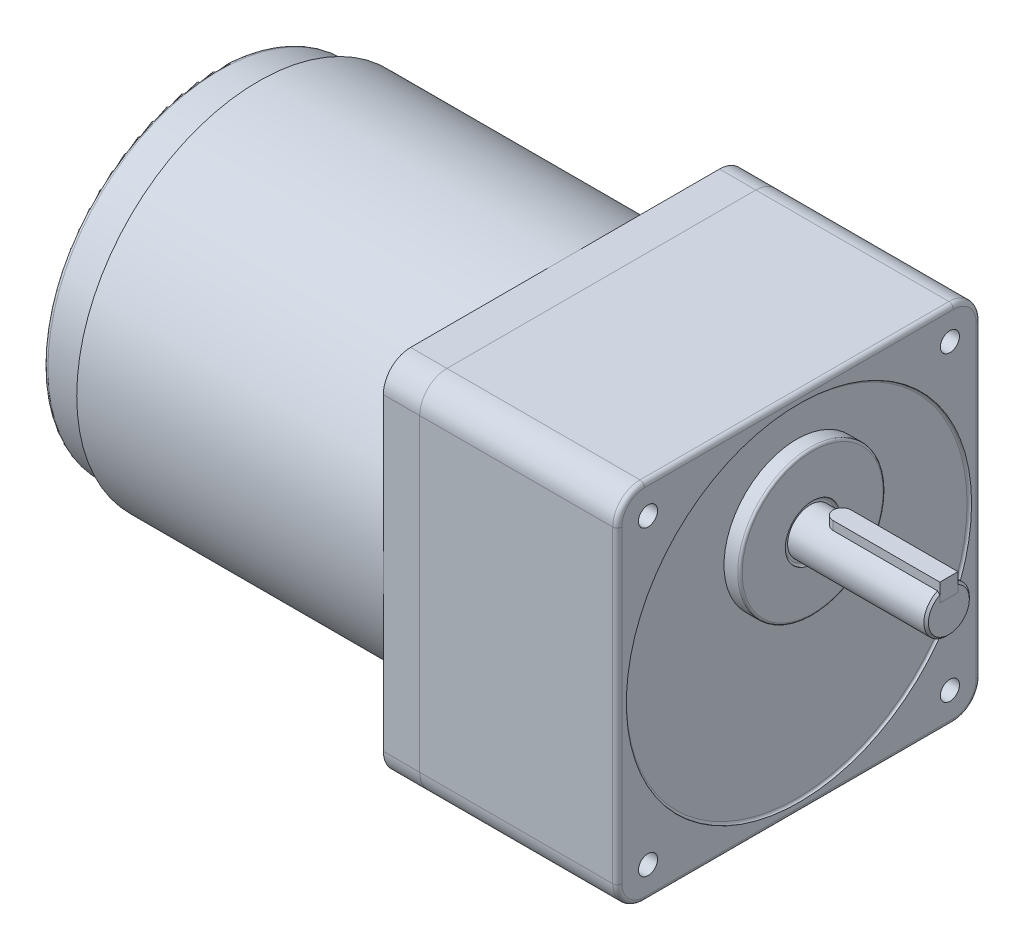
ISO-10303-21;
HEADER;
FILE_DESCRIPTION(('STEP AP214'),'2;1');
FILE_NAME('part.step','',(''),(''),'','','');
FILE_SCHEMA(('AUTOMOTIVE_DESIGN { 1 0 10303 214 1 1 1 1 }'));
ENDSEC;
DATA;
#1=APPLICATION_CONTEXT('core data for automotive mechanical design processes');
#2=APPLICATION_PROTOCOL_DEFINITION('international standard','automotive_design',2000,#1);
#3=PRODUCT_CONTEXT('',#1,'mechanical');
#4=PRODUCT('Part','Part','',(#3));
#5=PRODUCT_RELATED_PRODUCT_CATEGORY('part','',(#4));
#6=PRODUCT_DEFINITION_FORMATION('','',#4);
#7=PRODUCT_DEFINITION_CONTEXT('part definition',#1,'design');
#8=PRODUCT_DEFINITION('design','',#6,#7);
#9=PRODUCT_DEFINITION_SHAPE('','',#8);
#10=(LENGTH_UNIT() NAMED_UNIT(*) SI_UNIT(.MILLI.,.METRE.));
#11=(NAMED_UNIT(*) PLANE_ANGLE_UNIT() SI_UNIT($,.RADIAN.));
#12=(NAMED_UNIT(*) SI_UNIT($,.STERADIAN.) SOLID_ANGLE_UNIT());
#13=UNCERTAINTY_MEASURE_WITH_UNIT(LENGTH_MEASURE(1.E-05),#10,'distance_accuracy_value','');
#14=(GEOMETRIC_REPRESENTATION_CONTEXT(3) GLOBAL_UNCERTAINTY_ASSIGNED_CONTEXT((#13)) GLOBAL_UNIT_ASSIGNED_CONTEXT((#10,
#11,#12)) REPRESENTATION_CONTEXT('',''));
#15=CARTESIAN_POINT('',(0.,0.,0.));
#16=DIRECTION('',(0.,0.,1.));
#17=DIRECTION('',(1.,0.,0.));
#18=AXIS2_PLACEMENT_3D('',#15,#16,#17);
#19=CARTESIAN_POINT('',(9.5,21.5,0.));
#20=DIRECTION('',(0.,-1.,0.));
#21=DIRECTION('',(0.,0.,-1.));
#22=AXIS2_PLACEMENT_3D('',#19,#20,#21);
#23=CYLINDRICAL_SURFACE('',#22,2.);
#24=CARTESIAN_POINT('',(9.5,17.5,0.));
#25=DIRECTION('',(0.,1.,0.));
#26=DIRECTION('',(0.,0.,1.));
#27=AXIS2_PLACEMENT_3D('',#24,#25,#26);
#28=CIRCLE('',#27,2.);
#29=CARTESIAN_POINT('',(9.5,17.5,-2.));
#30=VERTEX_POINT('',#29);
#31=CARTESIAN_POINT('',(9.5,17.5,2.));
#32=VERTEX_POINT('',#31);
#33=EDGE_CURVE('E113',#30,#32,#28,.T.);
#34=ORIENTED_EDGE('',*,*,#33,.T.);
#35=DIRECTION('',(0.,-1.,0.));
#36=VECTOR('',#35,1.);
#37=CARTESIAN_POINT('',(9.5,21.5,2.));
#38=LINE('',#37,#36);
#39=CARTESIAN_POINT('',(9.5,21.5,2.));
#40=VERTEX_POINT('',#39);
#41=EDGE_CURVE('E12',#40,#32,#38,.T.);
#42=ORIENTED_EDGE('',*,*,#41,.F.);
#43=CARTESIAN_POINT('',(9.5,21.5,0.));
#44=DIRECTION('',(0.,1.,0.));
#45=DIRECTION('',(0.,0.,1.));
#46=AXIS2_PLACEMENT_3D('',#43,#44,#45);
#47=CIRCLE('',#46,2.);
#48=CARTESIAN_POINT('',(9.5,21.5,-2.));
#49=VERTEX_POINT('',#48);
#50=EDGE_CURVE('E101',#49,#40,#47,.T.);
#51=ORIENTED_EDGE('',*,*,#50,.F.);
#52=DIRECTION('',(0.,-1.,0.));
#53=VECTOR('',#52,1.);
#54=CARTESIAN_POINT('',(9.5,21.5,-2.));
#55=LINE('',#54,#53);
#56=EDGE_CURVE('E109',#49,#30,#55,.T.);
#57=ORIENTED_EDGE('',*,*,#56,.T.);
#58=EDGE_LOOP('',(#34,#42,#51,#57));
#59=FACE_BOUND('',#58,.T.);
#60=ADVANCED_FACE('F50',(#59),#23,.T.);
#61=CARTESIAN_POINT('',(33.,21.5,2.));
#62=DIRECTION('',(0.,0.,-1.));
#63=DIRECTION('',(-1.,0.,0.));
#64=AXIS2_PLACEMENT_3D('',#61,#62,#63);
#65=PLANE('',#64);
#66=DIRECTION('',(1.,0.,0.));
#67=VECTOR('',#66,1.);
#68=CARTESIAN_POINT('',(33.,17.5,2.));
#69=LINE('',#68,#67);
#70=CARTESIAN_POINT('',(33.,17.5,2.));
#71=VERTEX_POINT('',#70);
#72=EDGE_CURVE('E105',#32,#71,#69,.T.);
#73=ORIENTED_EDGE('',*,*,#72,.T.);
#74=DIRECTION('',(0.,-1.,0.));
#75=VECTOR('',#74,1.);
#76=CARTESIAN_POINT('',(33.,21.5,2.));
#77=LINE('',#76,#75);
#78=CARTESIAN_POINT('',(33.,21.5,2.));
#79=VERTEX_POINT('',#78);
#80=EDGE_CURVE('E58',#79,#71,#77,.T.);
#81=ORIENTED_EDGE('',*,*,#80,.F.);
#82=DIRECTION('',(1.,0.,0.));
#83=VECTOR('',#82,1.);
#84=CARTESIAN_POINT('',(33.,21.5,2.));
#85=LINE('',#84,#83);
#86=EDGE_CURVE('E96',#40,#79,#85,.T.);
#87=ORIENTED_EDGE('',*,*,#86,.F.);
#88=ORIENTED_EDGE('',*,*,#41,.T.);
#89=EDGE_LOOP('',(#73,#81,#87,#88));
#90=FACE_BOUND('',#89,.T.);
#91=ADVANCED_FACE('F104',(#90),#65,.F.);
#92=CARTESIAN_POINT('',(33.,21.5,-2.));
#93=DIRECTION('',(-1.,0.,0.));
#94=DIRECTION('',(0.,0.,1.));
#95=AXIS2_PLACEMENT_3D('',#92,#93,#94);
#96=PLANE('',#95);
#97=DIRECTION('',(0.,0.,-1.));
#98=VECTOR('',#97,1.);
#99=CARTESIAN_POINT('',(33.,17.5,-2.));
#100=LINE('',#99,#98);
#101=CARTESIAN_POINT('',(33.,17.5,-2.));
#102=VERTEX_POINT('',#101);
#103=EDGE_CURVE('E83',#71,#102,#100,.T.);
#104=ORIENTED_EDGE('',*,*,#103,.T.);
#105=DIRECTION('',(0.,-1.,0.));
#106=VECTOR('',#105,1.);
#107=CARTESIAN_POINT('',(33.,21.5,-2.));
#108=LINE('',#107,#106);
#109=CARTESIAN_POINT('',(33.,21.5,-2.));
#110=VERTEX_POINT('',#109);
#111=EDGE_CURVE('E106',#110,#102,#108,.T.);
#112=ORIENTED_EDGE('',*,*,#111,.F.);
#113=DIRECTION('',(0.,0.,-1.));
#114=VECTOR('',#113,1.);
#115=CARTESIAN_POINT('',(33.,21.5,-2.));
#116=LINE('',#115,#114);
#117=EDGE_CURVE('E99',#79,#110,#116,.T.);
#118=ORIENTED_EDGE('',*,*,#117,.F.);
#119=ORIENTED_EDGE('',*,*,#80,.T.);
#120=EDGE_LOOP('',(#104,#112,#118,#119));
#121=FACE_BOUND('',#120,.T.);
#122=ADVANCED_FACE('F107',(#121),#96,.F.);
#123=CARTESIAN_POINT('',(9.5,21.5,-2.));
#124=DIRECTION('',(0.,0.,1.));
#125=DIRECTION('',(1.,0.,0.));
#126=AXIS2_PLACEMENT_3D('',#123,#124,#125);
#127=PLANE('',#126);
#128=DIRECTION('',(-1.,0.,0.));
#129=VECTOR('',#128,1.);
#130=CARTESIAN_POINT('',(9.5,17.5,-2.));
#131=LINE('',#130,#129);
#132=EDGE_CURVE('E89',#102,#30,#131,.T.);
#133=ORIENTED_EDGE('',*,*,#132,.T.);
#134=ORIENTED_EDGE('',*,*,#56,.F.);
#135=DIRECTION('',(-1.,0.,0.));
#136=VECTOR('',#135,1.);
#137=CARTESIAN_POINT('',(9.5,21.5,-2.));
#138=LINE('',#137,#136);
#139=EDGE_CURVE('E66',#110,#49,#138,.T.);
#140=ORIENTED_EDGE('',*,*,#139,.F.);
#141=ORIENTED_EDGE('',*,*,#111,.T.);
#142=EDGE_LOOP('',(#133,#134,#140,#141));
#143=FACE_BOUND('',#142,.T.);
#144=ADVANCED_FACE('F120',(#143),#127,.F.);
#145=CARTESIAN_POINT('',(9.5,21.5,0.));
#146=DIRECTION('',(0.,1.,0.));
#147=DIRECTION('',(0.,0.,1.));
#148=AXIS2_PLACEMENT_3D('',#145,#146,#147);
#149=PLANE('',#148);
#150=ORIENTED_EDGE('',*,*,#50,.T.);
#151=ORIENTED_EDGE('',*,*,#86,.T.);
#152=ORIENTED_EDGE('',*,*,#117,.T.);
#153=ORIENTED_EDGE('',*,*,#139,.T.);
#154=EDGE_LOOP('',(#150,#151,#152,#153));
#155=FACE_BOUND('',#154,.T.);
#156=ADVANCED_FACE('F97',(#155),#149,.T.);
#157=CARTESIAN_POINT('',(9.5,17.5,0.));
#158=DIRECTION('',(0.,1.,0.));
#159=DIRECTION('',(0.,0.,1.));
#160=AXIS2_PLACEMENT_3D('',#157,#158,#159);
#161=PLANE('',#160);
#162=ORIENTED_EDGE('',*,*,#33,.F.);
#163=ORIENTED_EDGE('',*,*,#132,.F.);
#164=ORIENTED_EDGE('',*,*,#103,.F.);
#165=ORIENTED_EDGE('',*,*,#72,.F.);
#166=EDGE_LOOP('',(#162,#163,#164,#165));
#167=FACE_BOUND('',#166,.T.);
#168=ADVANCED_FACE('F123',(#167),#161,.F.);
#169=CLOSED_SHELL('',(#60,#91,#122,#144,#156,#168));
#170=MANIFOLD_SOLID_BREP('B2',#169);
#171=CARTESIAN_POINT('',(-119.,0.,0.));
#172=DIRECTION('',(-1.,0.,0.));
#173=DIRECTION('',(0.,0.,1.));
#174=AXIS2_PLACEMENT_3D('',#171,#172,#173);
#175=PLANE('',#174);
#176=CARTESIAN_POINT('',(-119.,0.,0.));
#177=DIRECTION('',(-1.,0.,0.));
#178=DIRECTION('',(0.,0.,1.));
#179=AXIS2_PLACEMENT_3D('',#176,#177,#178);
#180=CIRCLE('',#179,40.);
#181=CARTESIAN_POINT('',(-119.,0.,40.));
#182=VERTEX_POINT('',#181);
#183=EDGE_CURVE('E289',#182,#182,#180,.T.);
#184=ORIENTED_EDGE('',*,*,#183,.T.);
#185=EDGE_LOOP('',(#184));
#186=FACE_BOUND('',#185,.T.);
#187=CARTESIAN_POINT('',(-119.,0.,0.));
#188=DIRECTION('',(-1.,0.,0.));
#189=DIRECTION('',(0.,0.,1.));
#190=AXIS2_PLACEMENT_3D('',#187,#188,#189);
#191=CIRCLE('',#190,37.85);
#192=CARTESIAN_POINT('',(-119.,0.,37.85));
#193=VERTEX_POINT('',#192);
#194=EDGE_CURVE('E290',#193,#193,#191,.T.);
#195=ORIENTED_EDGE('',*,*,#194,.F.);
#196=EDGE_LOOP('',(#195));
#197=FACE_BOUND('',#196,.T.);
#198=ADVANCED_FACE('F183',(#186,#197),#175,.T.);
#199=CARTESIAN_POINT('',(-51.5,-34.,-34.));
#200=DIRECTION('',(1.,0.,0.));
#201=DIRECTION('',(0.,0.,-1.));
#202=AXIS2_PLACEMENT_3D('',#199,#200,#201);
#203=PLANE('',#202);
#204=CARTESIAN_POINT('',(-51.5,0.,0.));
#205=DIRECTION('',(-1.,0.,0.));
#206=DIRECTION('',(0.,0.,1.));
#207=AXIS2_PLACEMENT_3D('',#204,#205,#206);
#208=CIRCLE('',#207,40.);
#209=CARTESIAN_POINT('',(-51.5,0.,40.));
#210=VERTEX_POINT('',#209);
#211=CARTESIAN_POINT('',(-51.5,40.,0.));
#212=VERTEX_POINT('',#211);
#213=EDGE_CURVE('E284',#210,#212,#208,.T.);
#214=ORIENTED_EDGE('',*,*,#213,.F.);
#215=DIRECTION('',(0.,1.,0.));
#216=VECTOR('',#215,1.);
#217=CARTESIAN_POINT('',(-51.5,-34.,40.));
#218=LINE('',#217,#216);
#219=CARTESIAN_POINT('',(-51.5,34.,40.));
#220=VERTEX_POINT('',#219);
#221=EDGE_CURVE('E273',#210,#220,#218,.T.);
#222=ORIENTED_EDGE('',*,*,#221,.T.);
#223=CARTESIAN_POINT('',(-51.5,34.,34.));
#224=DIRECTION('',(-1.,0.,0.));
#225=DIRECTION('',(0.,0.,-1.));
#226=AXIS2_PLACEMENT_3D('',#223,#224,#225);
#227=CIRCLE('',#226,6.);
#228=CARTESIAN_POINT('',(-51.5,40.,34.));
#229=VERTEX_POINT('',#228);
#230=EDGE_CURVE('E272',#220,#229,#227,.T.);
#231=ORIENTED_EDGE('',*,*,#230,.T.);
#232=DIRECTION('',(0.,0.,-1.));
#233=VECTOR('',#232,1.);
#234=CARTESIAN_POINT('',(-51.5,40.,-34.));
#235=LINE('',#234,#233);
#236=EDGE_CURVE('E287',#229,#212,#235,.T.);
#237=ORIENTED_EDGE('',*,*,#236,.T.);
#238=EDGE_LOOP('',(#214,#222,#231,#237));
#239=FACE_BOUND('',#238,.T.);
#240=ADVANCED_FACE('F285',(#239),#203,.F.);
#241=CARTESIAN_POINT('',(-51.5,0.,-40.));
#242=VERTEX_POINT('',#241);
#243=EDGE_CURVE('E206',#212,#242,#208,.T.);
#244=ORIENTED_EDGE('',*,*,#243,.F.);
#245=CARTESIAN_POINT('',(-51.5,40.,-34.));
#246=VERTEX_POINT('',#245);
#247=EDGE_CURVE('E309',#212,#246,#235,.T.);
#248=ORIENTED_EDGE('',*,*,#247,.T.);
#249=CARTESIAN_POINT('',(-51.5,34.,-34.));
#250=DIRECTION('',(-1.,0.,0.));
#251=DIRECTION('',(0.,0.,-1.));
#252=AXIS2_PLACEMENT_3D('',#249,#250,#251);
#253=CIRCLE('',#252,6.);
#254=CARTESIAN_POINT('',(-51.5,34.,-40.));
#255=VERTEX_POINT('',#254);
#256=EDGE_CURVE('E311',#246,#255,#253,.T.);
#257=ORIENTED_EDGE('',*,*,#256,.T.);
#258=DIRECTION('',(0.,-1.,0.));
#259=VECTOR('',#258,1.);
#260=CARTESIAN_POINT('',(-51.5,-34.,-40.));
#261=LINE('',#260,#259);
#262=EDGE_CURVE('E314',#255,#242,#261,.T.);
#263=ORIENTED_EDGE('',*,*,#262,.T.);
#264=EDGE_LOOP('',(#244,#248,#257,#263));
#265=FACE_BOUND('',#264,.T.);
#266=ADVANCED_FACE('F367',(#265),#203,.F.);
#267=CARTESIAN_POINT('',(-51.5,-40.,0.));
#268=VERTEX_POINT('',#267);
#269=EDGE_CURVE('E198',#242,#268,#208,.T.);
#270=ORIENTED_EDGE('',*,*,#269,.F.);
#271=CARTESIAN_POINT('',(-51.5,-34.,-40.));
#272=VERTEX_POINT('',#271);
#273=EDGE_CURVE('E313',#242,#272,#261,.T.);
#274=ORIENTED_EDGE('',*,*,#273,.T.);
#275=CARTESIAN_POINT('',(-51.5,-34.,-34.));
#276=DIRECTION('',(-1.,0.,0.));
#277=DIRECTION('',(0.,0.,-1.));
#278=AXIS2_PLACEMENT_3D('',#275,#276,#277);
#279=CIRCLE('',#278,6.);
#280=CARTESIAN_POINT('',(-51.5,-40.,-34.));
#281=VERTEX_POINT('',#280);
#282=EDGE_CURVE('E300',#272,#281,#279,.T.);
#283=ORIENTED_EDGE('',*,*,#282,.T.);
#284=DIRECTION('',(0.,0.,1.));
#285=VECTOR('',#284,1.);
#286=CARTESIAN_POINT('',(-51.5,-40.,-34.));
#287=LINE('',#286,#285);
#288=EDGE_CURVE('E305',#281,#268,#287,.T.);
#289=ORIENTED_EDGE('',*,*,#288,.T.);
#290=EDGE_LOOP('',(#270,#274,#283,#289));
#291=FACE_BOUND('',#290,.T.);
#292=ADVANCED_FACE('F411',(#291),#203,.F.);
#293=EDGE_CURVE('E265',#268,#210,#208,.T.);
#294=ORIENTED_EDGE('',*,*,#293,.F.);
#295=CARTESIAN_POINT('',(-51.5,-40.,34.));
#296=VERTEX_POINT('',#295);
#297=EDGE_CURVE('E303',#268,#296,#287,.T.);
#298=ORIENTED_EDGE('',*,*,#297,.T.);
#299=CARTESIAN_POINT('',(-51.5,-34.,34.));
#300=DIRECTION('',(-1.,0.,0.));
#301=DIRECTION('',(0.,0.,1.));
#302=AXIS2_PLACEMENT_3D('',#299,#300,#301);
#303=CIRCLE('',#302,6.);
#304=CARTESIAN_POINT('',(-51.5,-34.,40.));
#305=VERTEX_POINT('',#304);
#306=EDGE_CURVE('E268',#296,#305,#303,.T.);
#307=ORIENTED_EDGE('',*,*,#306,.T.);
#308=EDGE_CURVE('E261',#305,#210,#218,.T.);
#309=ORIENTED_EDGE('',*,*,#308,.T.);
#310=EDGE_LOOP('',(#294,#298,#307,#309));
#311=FACE_BOUND('',#310,.T.);
#312=ADVANCED_FACE('F263',(#311),#203,.F.);
#313=CARTESIAN_POINT('',(-51.5,-34.,-34.));
#314=DIRECTION('',(1.,0.,0.));
#315=DIRECTION('',(0.,0.,-1.));
#316=AXIS2_PLACEMENT_3D('',#313,#314,#315);
#317=CYLINDRICAL_SURFACE('',#316,6.);
#318=CARTESIAN_POINT('',(-43.5,-34.,-34.));
#319=DIRECTION('',(-1.,0.,0.));
#320=DIRECTION('',(0.,0.,-1.));
#321=AXIS2_PLACEMENT_3D('',#318,#319,#320);
#322=CIRCLE('',#321,6.);
#323=CARTESIAN_POINT('',(-43.5,-34.,-40.));
#324=VERTEX_POINT('',#323);
#325=CARTESIAN_POINT('',(-43.5,-40.,-34.));
#326=VERTEX_POINT('',#325);
#327=EDGE_CURVE('E317',#324,#326,#322,.T.);
#328=ORIENTED_EDGE('',*,*,#327,.T.);
#329=DIRECTION('',(1.,0.,0.));
#330=VECTOR('',#329,1.);
#331=CARTESIAN_POINT('',(-51.5,-40.,-34.));
#332=LINE('',#331,#330);
#333=EDGE_CURVE('E293',#281,#326,#332,.T.);
#334=ORIENTED_EDGE('',*,*,#333,.F.);
#335=ORIENTED_EDGE('',*,*,#282,.F.);
#336=DIRECTION('',(1.,0.,0.));
#337=VECTOR('',#336,1.);
#338=CARTESIAN_POINT('',(-51.5,-34.,-40.));
#339=LINE('',#338,#337);
#340=EDGE_CURVE('E316',#272,#324,#339,.T.);
#341=ORIENTED_EDGE('',*,*,#340,.T.);
#342=EDGE_LOOP('',(#328,#334,#335,#341));
#343=FACE_BOUND('',#342,.T.);
#344=ADVANCED_FACE('F404',(#343),#317,.T.);
#345=CARTESIAN_POINT('',(-51.5,-40.,-34.));
#346=DIRECTION('',(0.,1.,0.));
#347=DIRECTION('',(0.,0.,1.));
#348=AXIS2_PLACEMENT_3D('',#345,#346,#347);
#349=PLANE('',#348);
#350=DIRECTION('',(0.,0.,1.));
#351=VECTOR('',#350,1.);
#352=CARTESIAN_POINT('',(-43.5,-40.,-34.));
#353=LINE('',#352,#351);
#354=CARTESIAN_POINT('',(-43.5,-40.,34.));
#355=VERTEX_POINT('',#354);
#356=EDGE_CURVE('E320',#326,#355,#353,.T.);
#357=ORIENTED_EDGE('',*,*,#356,.T.);
#358=DIRECTION('',(1.,0.,0.));
#359=VECTOR('',#358,1.);
#360=CARTESIAN_POINT('',(-51.5,-40.,34.));
#361=LINE('',#360,#359);
#362=EDGE_CURVE('E295',#296,#355,#361,.T.);
#363=ORIENTED_EDGE('',*,*,#362,.F.);
#364=ORIENTED_EDGE('',*,*,#297,.F.);
#365=ORIENTED_EDGE('',*,*,#288,.F.);
#366=ORIENTED_EDGE('',*,*,#333,.T.);
#367=EDGE_LOOP('',(#357,#363,#364,#365,#366));
#368=FACE_BOUND('',#367,.T.);
#369=ADVANCED_FACE('F401',(#368),#349,.F.);
#370=CARTESIAN_POINT('',(-51.5,-34.,34.));
#371=DIRECTION('',(1.,0.,0.));
#372=DIRECTION('',(0.,0.,-1.));
#373=AXIS2_PLACEMENT_3D('',#370,#371,#372);
#374=CYLINDRICAL_SURFACE('',#373,6.);
#375=CARTESIAN_POINT('',(-43.5,-34.,34.));
#376=DIRECTION('',(-1.,0.,0.));
#377=DIRECTION('',(0.,0.,1.));
#378=AXIS2_PLACEMENT_3D('',#375,#376,#377);
#379=CIRCLE('',#378,6.);
#380=CARTESIAN_POINT('',(-43.5,-34.,40.));
#381=VERTEX_POINT('',#380);
#382=EDGE_CURVE('E322',#355,#381,#379,.T.);
#383=ORIENTED_EDGE('',*,*,#382,.T.);
#384=DIRECTION('',(1.,0.,0.));
#385=VECTOR('',#384,1.);
#386=CARTESIAN_POINT('',(-51.5,-34.,40.));
#387=LINE('',#386,#385);
#388=EDGE_CURVE('E345',#305,#381,#387,.T.);
#389=ORIENTED_EDGE('',*,*,#388,.F.);
#390=ORIENTED_EDGE('',*,*,#306,.F.);
#391=ORIENTED_EDGE('',*,*,#362,.T.);
#392=EDGE_LOOP('',(#383,#389,#390,#391));
#393=FACE_BOUND('',#392,.T.);
#394=ADVANCED_FACE('F398',(#393),#374,.T.);
#395=CARTESIAN_POINT('',(-51.5,-34.,40.));
#396=DIRECTION('',(0.,0.,-1.));
#397=DIRECTION('',(-1.,0.,0.));
#398=AXIS2_PLACEMENT_3D('',#395,#396,#397);
#399=PLANE('',#398);
#400=DIRECTION('',(0.,1.,0.));
#401=VECTOR('',#400,1.);
#402=CARTESIAN_POINT('',(-43.5,-34.,40.));
#403=LINE('',#402,#401);
#404=CARTESIAN_POINT('',(-43.5,34.,40.));
#405=VERTEX_POINT('',#404);
#406=EDGE_CURVE('E324',#381,#405,#403,.T.);
#407=ORIENTED_EDGE('',*,*,#406,.T.);
#408=DIRECTION('',(1.,0.,0.));
#409=VECTOR('',#408,1.);
#410=CARTESIAN_POINT('',(-51.5,34.,40.));
#411=LINE('',#410,#409);
#412=EDGE_CURVE('E279',#220,#405,#411,.T.);
#413=ORIENTED_EDGE('',*,*,#412,.F.);
#414=ORIENTED_EDGE('',*,*,#221,.F.);
#415=ORIENTED_EDGE('',*,*,#308,.F.);
#416=ORIENTED_EDGE('',*,*,#388,.T.);
#417=EDGE_LOOP('',(#407,#413,#414,#415,#416));
#418=FACE_BOUND('',#417,.T.);
#419=ADVANCED_FACE('F277',(#418),#399,.F.);
#420=CARTESIAN_POINT('',(-51.5,34.,34.));
#421=DIRECTION('',(1.,0.,0.));
#422=DIRECTION('',(0.,0.,-1.));
#423=AXIS2_PLACEMENT_3D('',#420,#421,#422);
#424=CYLINDRICAL_SURFACE('',#423,6.);
#425=CARTESIAN_POINT('',(-43.5,34.,34.));
#426=DIRECTION('',(-1.,0.,0.));
#427=DIRECTION('',(0.,0.,-1.));
#428=AXIS2_PLACEMENT_3D('',#425,#426,#427);
#429=CIRCLE('',#428,6.);
#430=CARTESIAN_POINT('',(-43.5,40.,34.));
#431=VERTEX_POINT('',#430);
#432=EDGE_CURVE('E326',#405,#431,#429,.T.);
#433=ORIENTED_EDGE('',*,*,#432,.T.);
#434=DIRECTION('',(1.,0.,0.));
#435=VECTOR('',#434,1.);
#436=CARTESIAN_POINT('',(-51.5,40.,34.));
#437=LINE('',#436,#435);
#438=EDGE_CURVE('E341',#229,#431,#437,.T.);
#439=ORIENTED_EDGE('',*,*,#438,.F.);
#440=ORIENTED_EDGE('',*,*,#230,.F.);
#441=ORIENTED_EDGE('',*,*,#412,.T.);
#442=EDGE_LOOP('',(#433,#439,#440,#441));
#443=FACE_BOUND('',#442,.T.);
#444=ADVANCED_FACE('F391',(#443),#424,.T.);
#445=CARTESIAN_POINT('',(-51.5,40.,-34.));
#446=DIRECTION('',(0.,-1.,0.));
#447=DIRECTION('',(0.,0.,-1.));
#448=AXIS2_PLACEMENT_3D('',#445,#446,#447);
#449=PLANE('',#448);
#450=DIRECTION('',(0.,0.,-1.));
#451=VECTOR('',#450,1.);
#452=CARTESIAN_POINT('',(-43.5,40.,-34.));
#453=LINE('',#452,#451);
#454=CARTESIAN_POINT('',(-43.5,40.,-34.));
#455=VERTEX_POINT('',#454);
#456=EDGE_CURVE('E328',#431,#455,#453,.T.);
#457=ORIENTED_EDGE('',*,*,#456,.T.);
#458=DIRECTION('',(1.,0.,0.));
#459=VECTOR('',#458,1.);
#460=CARTESIAN_POINT('',(-51.5,40.,-34.));
#461=LINE('',#460,#459);
#462=EDGE_CURVE('E338',#246,#455,#461,.T.);
#463=ORIENTED_EDGE('',*,*,#462,.F.);
#464=ORIENTED_EDGE('',*,*,#247,.F.);
#465=ORIENTED_EDGE('',*,*,#236,.F.);
#466=ORIENTED_EDGE('',*,*,#438,.T.);
#467=EDGE_LOOP('',(#457,#463,#464,#465,#466));
#468=FACE_BOUND('',#467,.T.);
#469=ADVANCED_FACE('F387',(#468),#449,.F.);
#470=CARTESIAN_POINT('',(-51.5,34.,-34.));
#471=DIRECTION('',(1.,0.,0.));
#472=DIRECTION('',(0.,0.,-1.));
#473=AXIS2_PLACEMENT_3D('',#470,#471,#472);
#474=CYLINDRICAL_SURFACE('',#473,6.);
#475=CARTESIAN_POINT('',(-43.5,34.,-34.));
#476=DIRECTION('',(-1.,0.,0.));
#477=DIRECTION('',(0.,0.,-1.));
#478=AXIS2_PLACEMENT_3D('',#475,#476,#477);
#479=CIRCLE('',#478,6.);
#480=CARTESIAN_POINT('',(-43.5,34.,-40.));
#481=VERTEX_POINT('',#480);
#482=EDGE_CURVE('E330',#455,#481,#479,.T.);
#483=ORIENTED_EDGE('',*,*,#482,.T.);
#484=DIRECTION('',(1.,0.,0.));
#485=VECTOR('',#484,1.);
#486=CARTESIAN_POINT('',(-51.5,34.,-40.));
#487=LINE('',#486,#485);
#488=EDGE_CURVE('E335',#255,#481,#487,.T.);
#489=ORIENTED_EDGE('',*,*,#488,.F.);
#490=ORIENTED_EDGE('',*,*,#256,.F.);
#491=ORIENTED_EDGE('',*,*,#462,.T.);
#492=EDGE_LOOP('',(#483,#489,#490,#491));
#493=FACE_BOUND('',#492,.T.);
#494=ADVANCED_FACE('F383',(#493),#474,.T.);
#495=CARTESIAN_POINT('',(-51.5,-34.,-40.));
#496=DIRECTION('',(0.,0.,1.));
#497=DIRECTION('',(1.,0.,0.));
#498=AXIS2_PLACEMENT_3D('',#495,#496,#497);
#499=PLANE('',#498);
#500=DIRECTION('',(0.,-1.,0.));
#501=VECTOR('',#500,1.);
#502=CARTESIAN_POINT('',(-43.5,-34.,-40.));
#503=LINE('',#502,#501);
#504=EDGE_CURVE('E304',#481,#324,#503,.T.);
#505=ORIENTED_EDGE('',*,*,#504,.T.);
#506=ORIENTED_EDGE('',*,*,#340,.F.);
#507=ORIENTED_EDGE('',*,*,#273,.F.);
#508=ORIENTED_EDGE('',*,*,#262,.F.);
#509=ORIENTED_EDGE('',*,*,#488,.T.);
#510=EDGE_LOOP('',(#505,#506,#507,#508,#509));
#511=FACE_BOUND('',#510,.T.);
#512=ADVANCED_FACE('F379',(#511),#499,.F.);
#513=CARTESIAN_POINT('',(-43.5,-34.,-34.));
#514=DIRECTION('',(1.,0.,0.));
#515=DIRECTION('',(0.,0.,-1.));
#516=AXIS2_PLACEMENT_3D('',#513,#514,#515);
#517=PLANE('',#516);
#518=ORIENTED_EDGE('',*,*,#327,.F.);
#519=ORIENTED_EDGE('',*,*,#504,.F.);
#520=ORIENTED_EDGE('',*,*,#482,.F.);
#521=ORIENTED_EDGE('',*,*,#456,.F.);
#522=ORIENTED_EDGE('',*,*,#432,.F.);
#523=ORIENTED_EDGE('',*,*,#406,.F.);
#524=ORIENTED_EDGE('',*,*,#382,.F.);
#525=ORIENTED_EDGE('',*,*,#356,.F.);
#526=EDGE_LOOP('',(#518,#519,#520,#521,#522,#523,#524,#525));
#527=FACE_BOUND('',#526,.T.);
#528=ADVANCED_FACE('F374',(#527),#517,.T.);
#529=CARTESIAN_POINT('',(-119.,0.,0.));
#530=DIRECTION('',(1.,0.,0.));
#531=DIRECTION('',(0.,0.,-1.));
#532=AXIS2_PLACEMENT_3D('',#529,#530,#531);
#533=CYLINDRICAL_SURFACE('',#532,40.);
#534=ORIENTED_EDGE('',*,*,#183,.F.);
#535=EDGE_LOOP('',(#534));
#536=FACE_BOUND('',#535,.T.);
#537=ORIENTED_EDGE('',*,*,#213,.T.);
#538=ORIENTED_EDGE('',*,*,#243,.T.);
#539=ORIENTED_EDGE('',*,*,#269,.T.);
#540=ORIENTED_EDGE('',*,*,#293,.T.);
#541=EDGE_LOOP('',(#537,#538,#539,#540));
#542=FACE_BOUND('',#541,.T.);
#543=ADVANCED_FACE('F292',(#536,#542),#533,.T.);
#544=CARTESIAN_POINT('',(-128.5,0.,0.));
#545=DIRECTION('',(1.,0.,0.));
#546=DIRECTION('',(0.,0.,-1.));
#547=AXIS2_PLACEMENT_3D('',#544,#545,#546);
#548=CYLINDRICAL_SURFACE('',#547,37.85);
#549=CARTESIAN_POINT('',(-127.5,0.,0.));
#550=DIRECTION('',(-1.,0.,0.));
#551=DIRECTION('',(0.,0.,1.));
#552=AXIS2_PLACEMENT_3D('',#549,#550,#551);
#553=CIRCLE('',#552,37.85);
#554=CARTESIAN_POINT('',(-127.5,0.,37.85));
#555=VERTEX_POINT('',#554);
#556=EDGE_CURVE('E48',#555,#555,#553,.F.);
#557=ORIENTED_EDGE('',*,*,#556,.T.);
#558=EDGE_LOOP('',(#557));
#559=FACE_BOUND('',#558,.T.);
#560=ORIENTED_EDGE('',*,*,#194,.T.);
#561=EDGE_LOOP('',(#560));
#562=FACE_BOUND('',#561,.T.);
#563=ADVANCED_FACE('F358',(#559,#562),#548,.T.);
#564=CARTESIAN_POINT('',(-128.5,0.,0.));
#565=DIRECTION('',(-1.,0.,0.));
#566=DIRECTION('',(0.,0.,1.));
#567=AXIS2_PLACEMENT_3D('',#564,#565,#566);
#568=PLANE('',#567);
#569=CARTESIAN_POINT('',(-128.5,0.,0.));
#570=DIRECTION('',(-1.,0.,0.));
#571=DIRECTION('',(0.,0.,1.));
#572=AXIS2_PLACEMENT_3D('',#569,#570,#571);
#573=CIRCLE('',#572,36.85);
#574=CARTESIAN_POINT('',(-128.5,0.,36.85));
#575=VERTEX_POINT('',#574);
#576=EDGE_CURVE('E191',#575,#575,#573,.T.);
#577=ORIENTED_EDGE('',*,*,#576,.T.);
#578=EDGE_LOOP('',(#577));
#579=FACE_BOUND('',#578,.T.);
#580=ADVANCED_FACE('F351',(#579),#568,.T.);
#581=CARTESIAN_POINT('',(-127.5,0.,0.));
#582=DIRECTION('',(-1.,0.,0.));
#583=DIRECTION('',(0.,0.,1.));
#584=AXIS2_PLACEMENT_3D('',#581,#582,#583);
#585=TOROIDAL_SURFACE('',#584,36.85,1.);
#586=ORIENTED_EDGE('',*,*,#556,.F.);
#587=EDGE_LOOP('',(#586));
#588=FACE_BOUND('',#587,.T.);
#589=ORIENTED_EDGE('',*,*,#576,.F.);
#590=EDGE_LOOP('',(#589));
#591=FACE_BOUND('',#590,.T.);
#592=ADVANCED_FACE('F185',(#588,#591),#585,.T.);
#593=CLOSED_SHELL('',(#198,#240,#266,#292,#312,#344,#369,#394,#419,#444,#469,#494,#512,#528,
#543,#563,#580,#592));
#594=MANIFOLD_SOLID_BREP('B6',#593);
#595=CARTESIAN_POINT('',(2.5,15.,0.));
#596=DIRECTION('',(1.,0.,0.));
#597=DIRECTION('',(0.,0.,-1.));
#598=AXIS2_PLACEMENT_3D('',#595,#596,#597);
#599=PLANE('',#598);
#600=CARTESIAN_POINT('',(2.5,15.,0.));
#601=DIRECTION('',(1.,0.,0.));
#602=DIRECTION('',(0.,0.,-1.));
#603=AXIS2_PLACEMENT_3D('',#600,#601,#602);
#604=CIRCLE('',#603,5.5);
#605=CARTESIAN_POINT('',(2.5,15.,-5.5));
#606=VERTEX_POINT('',#605);
#607=EDGE_CURVE('E861',#606,#606,#604,.T.);
#608=ORIENTED_EDGE('',*,*,#607,.T.);
#609=EDGE_LOOP('',(#608));
#610=FACE_BOUND('',#609,.T.);
#611=CARTESIAN_POINT('',(2.5,15.,0.));
#612=DIRECTION('',(1.,0.,0.));
#613=DIRECTION('',(0.,0.,-1.));
#614=AXIS2_PLACEMENT_3D('',#611,#612,#613);
#615=CIRCLE('',#614,5.);
#616=CARTESIAN_POINT('',(2.5,15.,-5.));
#617=VERTEX_POINT('',#616);
#618=EDGE_CURVE('E712',#617,#617,#615,.T.);
#619=ORIENTED_EDGE('',*,*,#618,.F.);
#620=EDGE_LOOP('',(#619));
#621=FACE_BOUND('',#620,.T.);
#622=ADVANCED_FACE('F541',(#610,#621),#599,.T.);
#623=CARTESIAN_POINT('',(-0.5,0.,0.));
#624=DIRECTION('',(1.,0.,0.));
#625=DIRECTION('',(0.,0.,-1.));
#626=AXIS2_PLACEMENT_3D('',#623,#624,#625);
#627=PLANE('',#626);
#628=CARTESIAN_POINT('',(-0.5,0.,0.));
#629=DIRECTION('',(1.,0.,0.));
#630=DIRECTION('',(0.,0.,-1.));
#631=AXIS2_PLACEMENT_3D('',#628,#629,#630);
#632=CIRCLE('',#631,37.5);
#633=CARTESIAN_POINT('',(-0.5,0.,-37.5));
#634=VERTEX_POINT('',#633);
#635=EDGE_CURVE('E832',#634,#634,#632,.T.);
#636=ORIENTED_EDGE('',*,*,#635,.T.);
#637=EDGE_LOOP('',(#636));
#638=FACE_BOUND('',#637,.T.);
#639=CARTESIAN_POINT('',(-0.5,15.,0.));
#640=DIRECTION('',(1.,0.,0.));
#641=DIRECTION('',(0.,0.,-1.));
#642=AXIS2_PLACEMENT_3D('',#639,#640,#641);
#643=CIRCLE('',#642,16.);
#644=CARTESIAN_POINT('',(-0.5,15.,-16.));
#645=VERTEX_POINT('',#644);
#646=EDGE_CURVE('E718',#645,#645,#643,.T.);
#647=ORIENTED_EDGE('',*,*,#646,.F.);
#648=EDGE_LOOP('',(#647));
#649=FACE_BOUND('',#648,.T.);
#650=ADVANCED_FACE('F889',(#638,#649),#627,.T.);
#651=CARTESIAN_POINT('',(-43.5,-34.,34.));
#652=DIRECTION('',(1.,0.,0.));
#653=DIRECTION('',(0.,0.,-1.));
#654=AXIS2_PLACEMENT_3D('',#651,#652,#653);
#655=CYLINDRICAL_SURFACE('',#654,6.);
#656=DIRECTION('',(1.,0.,0.));
#657=VECTOR('',#656,1.);
#658=CARTESIAN_POINT('',(-43.5,-40.,34.));
#659=LINE('',#658,#657);
#660=CARTESIAN_POINT('',(-43.5,-40.,34.));
#661=VERTEX_POINT('',#660);
#662=CARTESIAN_POINT('',(-1.,-40.,34.));
#663=VERTEX_POINT('',#662);
#664=EDGE_CURVE('E774',#661,#663,#659,.T.);
#665=ORIENTED_EDGE('',*,*,#664,.T.);
#666=CARTESIAN_POINT('',(-1.,-34.,34.));
#667=DIRECTION('',(-1.,0.,0.));
#668=DIRECTION('',(0.,0.,1.));
#669=AXIS2_PLACEMENT_3D('',#666,#667,#668);
#670=CIRCLE('',#669,6.);
#671=CARTESIAN_POINT('',(-1.,-34.,40.));
#672=VERTEX_POINT('',#671);
#673=EDGE_CURVE('E830',#663,#672,#670,.T.);
#674=ORIENTED_EDGE('',*,*,#673,.T.);
#675=DIRECTION('',(1.,0.,0.));
#676=VECTOR('',#675,1.);
#677=CARTESIAN_POINT('',(-43.5,-34.,40.));
#678=LINE('',#677,#676);
#679=CARTESIAN_POINT('',(-43.5,-34.,40.));
#680=VERTEX_POINT('',#679);
#681=EDGE_CURVE('E775',#680,#672,#678,.T.);
#682=ORIENTED_EDGE('',*,*,#681,.F.);
#683=CARTESIAN_POINT('',(-43.5,-34.,34.));
#684=DIRECTION('',(1.,0.,0.));
#685=DIRECTION('',(0.,0.,1.));
#686=AXIS2_PLACEMENT_3D('',#683,#684,#685);
#687=CIRCLE('',#686,6.);
#688=EDGE_CURVE('E749',#680,#661,#687,.T.);
#689=ORIENTED_EDGE('',*,*,#688,.T.);
#690=EDGE_LOOP('',(#665,#674,#682,#689));
#691=FACE_BOUND('',#690,.T.);
#692=ADVANCED_FACE('F894',(#691),#655,.T.);
#693=CARTESIAN_POINT('',(-43.5,-34.,40.));
#694=DIRECTION('',(0.,0.,1.));
#695=DIRECTION('',(1.,0.,0.));
#696=AXIS2_PLACEMENT_3D('',#693,#694,#695);
#697=PLANE('',#696);
#698=ORIENTED_EDGE('',*,*,#681,.T.);
#699=DIRECTION('',(0.,-1.,0.));
#700=VECTOR('',#699,1.);
#701=CARTESIAN_POINT('',(-1.,34.,40.));
#702=LINE('',#701,#700);
#703=CARTESIAN_POINT('',(-1.,34.,40.));
#704=VERTEX_POINT('',#703);
#705=EDGE_CURVE('E815',#672,#704,#702,.F.);
#706=ORIENTED_EDGE('',*,*,#705,.T.);
#707=DIRECTION('',(1.,0.,0.));
#708=VECTOR('',#707,1.);
#709=CARTESIAN_POINT('',(-43.5,34.,40.));
#710=LINE('',#709,#708);
#711=CARTESIAN_POINT('',(-43.5,34.,40.));
#712=VERTEX_POINT('',#711);
#713=EDGE_CURVE('E779',#712,#704,#710,.T.);
#714=ORIENTED_EDGE('',*,*,#713,.F.);
#715=DIRECTION('',(0.,-1.,0.));
#716=VECTOR('',#715,1.);
#717=CARTESIAN_POINT('',(-43.5,-34.,40.));
#718=LINE('',#717,#716);
#719=EDGE_CURVE('E771',#712,#680,#718,.T.);
#720=ORIENTED_EDGE('',*,*,#719,.T.);
#721=EDGE_LOOP('',(#698,#706,#714,#720));
#722=FACE_BOUND('',#721,.T.);
#723=ADVANCED_FACE('F952',(#722),#697,.T.);
#724=CARTESIAN_POINT('',(-43.5,34.,34.));
#725=DIRECTION('',(1.,0.,0.));
#726=DIRECTION('',(0.,0.,-1.));
#727=AXIS2_PLACEMENT_3D('',#724,#725,#726);
#728=CYLINDRICAL_SURFACE('',#727,6.);
#729=ORIENTED_EDGE('',*,*,#713,.T.);
#730=CARTESIAN_POINT('',(-1.,34.,34.));
#731=DIRECTION('',(-1.,0.,0.));
#732=DIRECTION('',(0.,0.,1.));
#733=AXIS2_PLACEMENT_3D('',#730,#731,#732);
#734=CIRCLE('',#733,6.);
#735=CARTESIAN_POINT('',(-1.,40.,34.));
#736=VERTEX_POINT('',#735);
#737=EDGE_CURVE('E818',#704,#736,#734,.T.);
#738=ORIENTED_EDGE('',*,*,#737,.T.);
#739=DIRECTION('',(1.,0.,0.));
#740=VECTOR('',#739,1.);
#741=CARTESIAN_POINT('',(-43.5,40.,34.));
#742=LINE('',#741,#740);
#743=CARTESIAN_POINT('',(-43.5,40.,34.));
#744=VERTEX_POINT('',#743);
#745=EDGE_CURVE('E782',#744,#736,#742,.T.);
#746=ORIENTED_EDGE('',*,*,#745,.F.);
#747=CARTESIAN_POINT('',(-43.5,34.,34.));
#748=DIRECTION('',(1.,0.,0.));
#749=DIRECTION('',(0.,0.,1.));
#750=AXIS2_PLACEMENT_3D('',#747,#748,#749);
#751=CIRCLE('',#750,6.);
#752=EDGE_CURVE('E768',#744,#712,#751,.T.);
#753=ORIENTED_EDGE('',*,*,#752,.T.);
#754=EDGE_LOOP('',(#729,#738,#746,#753));
#755=FACE_BOUND('',#754,.T.);
#756=ADVANCED_FACE('F955',(#755),#728,.T.);
#757=CARTESIAN_POINT('',(-43.5,40.,34.));
#758=DIRECTION('',(0.,1.,0.));
#759=DIRECTION('',(0.,0.,1.));
#760=AXIS2_PLACEMENT_3D('',#757,#758,#759);
#761=PLANE('',#760);
#762=ORIENTED_EDGE('',*,*,#745,.T.);
#763=DIRECTION('',(0.,0.,1.));
#764=VECTOR('',#763,1.);
#765=CARTESIAN_POINT('',(-1.,40.,-34.));
#766=LINE('',#765,#764);
#767=CARTESIAN_POINT('',(-1.,40.,-34.));
#768=VERTEX_POINT('',#767);
#769=EDGE_CURVE('E820',#736,#768,#766,.F.);
#770=ORIENTED_EDGE('',*,*,#769,.T.);
#771=DIRECTION('',(1.,0.,0.));
#772=VECTOR('',#771,1.);
#773=CARTESIAN_POINT('',(-43.5,40.,-34.));
#774=LINE('',#773,#772);
#775=CARTESIAN_POINT('',(-43.5,40.,-34.));
#776=VERTEX_POINT('',#775);
#777=EDGE_CURVE('E785',#776,#768,#774,.T.);
#778=ORIENTED_EDGE('',*,*,#777,.F.);
#779=DIRECTION('',(0.,0.,1.));
#780=VECTOR('',#779,1.);
#781=CARTESIAN_POINT('',(-43.5,40.,34.));
#782=LINE('',#781,#780);
#783=EDGE_CURVE('E765',#776,#744,#782,.T.);
#784=ORIENTED_EDGE('',*,*,#783,.T.);
#785=EDGE_LOOP('',(#762,#770,#778,#784));
#786=FACE_BOUND('',#785,.T.);
#787=ADVANCED_FACE('F959',(#786),#761,.T.);
#788=CARTESIAN_POINT('',(-43.5,34.,-34.));
#789=DIRECTION('',(1.,0.,0.));
#790=DIRECTION('',(0.,0.,-1.));
#791=AXIS2_PLACEMENT_3D('',#788,#789,#790);
#792=CYLINDRICAL_SURFACE('',#791,6.);
#793=ORIENTED_EDGE('',*,*,#777,.T.);
#794=CARTESIAN_POINT('',(-1.,34.,-34.));
#795=DIRECTION('',(-1.,0.,0.));
#796=DIRECTION('',(0.,0.,1.));
#797=AXIS2_PLACEMENT_3D('',#794,#795,#796);
#798=CIRCLE('',#797,6.);
#799=CARTESIAN_POINT('',(-1.,34.,-40.));
#800=VERTEX_POINT('',#799);
#801=EDGE_CURVE('E822',#768,#800,#798,.T.);
#802=ORIENTED_EDGE('',*,*,#801,.T.);
#803=DIRECTION('',(1.,0.,0.));
#804=VECTOR('',#803,1.);
#805=CARTESIAN_POINT('',(-43.5,34.,-40.));
#806=LINE('',#805,#804);
#807=CARTESIAN_POINT('',(-43.5,34.,-40.));
#808=VERTEX_POINT('',#807);
#809=EDGE_CURVE('E788',#808,#800,#806,.T.);
#810=ORIENTED_EDGE('',*,*,#809,.F.);
#811=CARTESIAN_POINT('',(-43.5,34.,-34.));
#812=DIRECTION('',(1.,0.,0.));
#813=DIRECTION('',(0.,0.,1.));
#814=AXIS2_PLACEMENT_3D('',#811,#812,#813);
#815=CIRCLE('',#814,6.);
#816=EDGE_CURVE('E762',#808,#776,#815,.T.);
#817=ORIENTED_EDGE('',*,*,#816,.T.);
#818=EDGE_LOOP('',(#793,#802,#810,#817));
#819=FACE_BOUND('',#818,.T.);
#820=ADVANCED_FACE('F963',(#819),#792,.T.);
#821=CARTESIAN_POINT('',(-43.5,-34.,-40.));
#822=DIRECTION('',(0.,0.,-1.));
#823=DIRECTION('',(-1.,0.,0.));
#824=AXIS2_PLACEMENT_3D('',#821,#822,#823);
#825=PLANE('',#824);
#826=ORIENTED_EDGE('',*,*,#809,.T.);
#827=DIRECTION('',(0.,1.,0.));
#828=VECTOR('',#827,1.);
#829=CARTESIAN_POINT('',(-1.,-34.,-40.));
#830=LINE('',#829,#828);
#831=CARTESIAN_POINT('',(-1.,-34.,-40.));
#832=VERTEX_POINT('',#831);
#833=EDGE_CURVE('E824',#800,#832,#830,.F.);
#834=ORIENTED_EDGE('',*,*,#833,.T.);
#835=DIRECTION('',(1.,0.,0.));
#836=VECTOR('',#835,1.);
#837=CARTESIAN_POINT('',(-43.5,-34.,-40.));
#838=LINE('',#837,#836);
#839=CARTESIAN_POINT('',(-43.5,-34.,-40.));
#840=VERTEX_POINT('',#839);
#841=EDGE_CURVE('E791',#840,#832,#838,.T.);
#842=ORIENTED_EDGE('',*,*,#841,.F.);
#843=DIRECTION('',(0.,1.,0.));
#844=VECTOR('',#843,1.);
#845=CARTESIAN_POINT('',(-43.5,-34.,-40.));
#846=LINE('',#845,#844);
#847=EDGE_CURVE('E759',#840,#808,#846,.T.);
#848=ORIENTED_EDGE('',*,*,#847,.T.);
#849=EDGE_LOOP('',(#826,#834,#842,#848));
#850=FACE_BOUND('',#849,.T.);
#851=ADVANCED_FACE('F967',(#850),#825,.T.);
#852=CARTESIAN_POINT('',(-43.5,-34.,-34.));
#853=DIRECTION('',(1.,0.,0.));
#854=DIRECTION('',(0.,0.,-1.));
#855=AXIS2_PLACEMENT_3D('',#852,#853,#854);
#856=CYLINDRICAL_SURFACE('',#855,6.);
#857=ORIENTED_EDGE('',*,*,#841,.T.);
#858=CARTESIAN_POINT('',(-1.,-34.,-34.));
#859=DIRECTION('',(-1.,0.,0.));
#860=DIRECTION('',(0.,0.,1.));
#861=AXIS2_PLACEMENT_3D('',#858,#859,#860);
#862=CIRCLE('',#861,6.);
#863=CARTESIAN_POINT('',(-1.,-40.,-34.));
#864=VERTEX_POINT('',#863);
#865=EDGE_CURVE('E826',#832,#864,#862,.T.);
#866=ORIENTED_EDGE('',*,*,#865,.T.);
#867=DIRECTION('',(1.,0.,0.));
#868=VECTOR('',#867,1.);
#869=CARTESIAN_POINT('',(-43.5,-40.,-34.));
#870=LINE('',#869,#868);
#871=CARTESIAN_POINT('',(-43.5,-40.,-34.));
#872=VERTEX_POINT('',#871);
#873=EDGE_CURVE('E794',#872,#864,#870,.T.);
#874=ORIENTED_EDGE('',*,*,#873,.F.);
#875=CARTESIAN_POINT('',(-43.5,-34.,-34.));
#876=DIRECTION('',(1.,0.,0.));
#877=DIRECTION('',(0.,0.,-1.));
#878=AXIS2_PLACEMENT_3D('',#875,#876,#877);
#879=CIRCLE('',#878,6.);
#880=EDGE_CURVE('E756',#872,#840,#879,.T.);
#881=ORIENTED_EDGE('',*,*,#880,.T.);
#882=EDGE_LOOP('',(#857,#866,#874,#881));
#883=FACE_BOUND('',#882,.T.);
#884=ADVANCED_FACE('F971',(#883),#856,.T.);
#885=CARTESIAN_POINT('',(-43.5,-40.,34.));
#886=DIRECTION('',(0.,-1.,0.));
#887=DIRECTION('',(0.,0.,-1.));
#888=AXIS2_PLACEMENT_3D('',#885,#886,#887);
#889=PLANE('',#888);
#890=ORIENTED_EDGE('',*,*,#873,.T.);
#891=DIRECTION('',(0.,0.,-1.));
#892=VECTOR('',#891,1.);
#893=CARTESIAN_POINT('',(-1.,-40.,34.));
#894=LINE('',#893,#892);
#895=EDGE_CURVE('E828',#864,#663,#894,.F.);
#896=ORIENTED_EDGE('',*,*,#895,.T.);
#897=ORIENTED_EDGE('',*,*,#664,.F.);
#898=DIRECTION('',(0.,0.,-1.));
#899=VECTOR('',#898,1.);
#900=CARTESIAN_POINT('',(-43.5,-40.,34.));
#901=LINE('',#900,#899);
#902=EDGE_CURVE('E752',#661,#872,#901,.T.);
#903=ORIENTED_EDGE('',*,*,#902,.T.);
#904=EDGE_LOOP('',(#890,#896,#897,#903));
#905=FACE_BOUND('',#904,.T.);
#906=ADVANCED_FACE('F946',(#905),#889,.T.);
#907=CARTESIAN_POINT('',(-43.5,-34.,34.));
#908=DIRECTION('',(-1.,0.,0.));
#909=DIRECTION('',(0.,0.,1.));
#910=AXIS2_PLACEMENT_3D('',#907,#908,#909);
#911=PLANE('',#910);
#912=ORIENTED_EDGE('',*,*,#688,.F.);
#913=ORIENTED_EDGE('',*,*,#719,.F.);
#914=ORIENTED_EDGE('',*,*,#752,.F.);
#915=ORIENTED_EDGE('',*,*,#783,.F.);
#916=ORIENTED_EDGE('',*,*,#816,.F.);
#917=ORIENTED_EDGE('',*,*,#847,.F.);
#918=ORIENTED_EDGE('',*,*,#880,.F.);
#919=ORIENTED_EDGE('',*,*,#902,.F.);
#920=EDGE_LOOP('',(#912,#913,#914,#915,#916,#917,#918,#919));
#921=FACE_BOUND('',#920,.T.);
#922=ADVANCED_FACE('F942',(#921),#911,.T.);
#923=CARTESIAN_POINT('',(0.,-34.,34.));
#924=DIRECTION('',(-1.,0.,0.));
#925=DIRECTION('',(0.,0.,1.));
#926=AXIS2_PLACEMENT_3D('',#923,#924,#925);
#927=PLANE('',#926);
#928=CARTESIAN_POINT('',(0.,0.,0.));
#929=DIRECTION('',(1.,0.,0.));
#930=DIRECTION('',(0.,0.,-1.));
#931=AXIS2_PLACEMENT_3D('',#928,#929,#930);
#932=CIRCLE('',#931,38.);
#933=CARTESIAN_POINT('',(0.,0.,-38.));
#934=VERTEX_POINT('',#933);
#935=EDGE_CURVE('E721',#934,#934,#932,.T.);
#936=ORIENTED_EDGE('',*,*,#935,.F.);
#937=EDGE_LOOP('',(#936));
#938=FACE_BOUND('',#937,.T.);
#939=CARTESIAN_POINT('',(0.,33.2340187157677,33.2340187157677));
#940=DIRECTION('',(1.,0.,0.));
#941=DIRECTION('',(0.,0.,-1.));
#942=AXIS2_PLACEMENT_3D('',#939,#940,#941);
#943=CIRCLE('',#942,2.09999999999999);
#944=CARTESIAN_POINT('',(0.,33.2340187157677,31.1340187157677));
#945=VERTEX_POINT('',#944);
#946=EDGE_CURVE('E724',#945,#945,#943,.T.);
#947=ORIENTED_EDGE('',*,*,#946,.F.);
#948=EDGE_LOOP('',(#947));
#949=FACE_BOUND('',#948,.T.);
#950=CARTESIAN_POINT('',(0.,-33.2340187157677,33.2340187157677));
#951=DIRECTION('',(1.,0.,0.));
#952=DIRECTION('',(0.,0.,-1.));
#953=AXIS2_PLACEMENT_3D('',#950,#951,#952);
#954=CIRCLE('',#953,2.09999999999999);
#955=CARTESIAN_POINT('',(0.,-33.2340187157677,31.1340187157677));
#956=VERTEX_POINT('',#955);
#957=EDGE_CURVE('E730',#956,#956,#954,.T.);
#958=ORIENTED_EDGE('',*,*,#957,.F.);
#959=EDGE_LOOP('',(#958));
#960=FACE_BOUND('',#959,.T.);
#961=CARTESIAN_POINT('',(0.,-33.2340187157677,-33.2340187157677));
#962=DIRECTION('',(1.,0.,0.));
#963=DIRECTION('',(0.,0.,-1.));
#964=AXIS2_PLACEMENT_3D('',#961,#962,#963);
#965=CIRCLE('',#964,2.09999999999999);
#966=CARTESIAN_POINT('',(0.,-33.2340187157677,-35.3340187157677));
#967=VERTEX_POINT('',#966);
#968=EDGE_CURVE('E736',#967,#967,#965,.T.);
#969=ORIENTED_EDGE('',*,*,#968,.F.);
#970=EDGE_LOOP('',(#969));
#971=FACE_BOUND('',#970,.T.);
#972=CARTESIAN_POINT('',(0.,33.2340187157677,-33.2340187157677));
#973=DIRECTION('',(1.,0.,0.));
#974=DIRECTION('',(0.,0.,-1.));
#975=AXIS2_PLACEMENT_3D('',#972,#973,#974);
#976=CIRCLE('',#975,2.09999999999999);
#977=CARTESIAN_POINT('',(0.,33.2340187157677,-35.3340187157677));
#978=VERTEX_POINT('',#977);
#979=EDGE_CURVE('E742',#978,#978,#976,.T.);
#980=ORIENTED_EDGE('',*,*,#979,.F.);
#981=EDGE_LOOP('',(#980));
#982=FACE_BOUND('',#981,.T.);
#983=CARTESIAN_POINT('',(0.,34.,34.));
#984=DIRECTION('',(-1.,0.,0.));
#985=DIRECTION('',(0.,0.,1.));
#986=AXIS2_PLACEMENT_3D('',#983,#984,#985);
#987=CIRCLE('',#986,5.);
#988=CARTESIAN_POINT('',(0.,39.,34.));
#989=VERTEX_POINT('',#988);
#990=CARTESIAN_POINT('',(0.,34.,39.));
#991=VERTEX_POINT('',#990);
#992=EDGE_CURVE('E810',#989,#991,#987,.F.);
#993=ORIENTED_EDGE('',*,*,#992,.T.);
#994=DIRECTION('',(0.,-1.,0.));
#995=VECTOR('',#994,1.);
#996=CARTESIAN_POINT('',(0.,-34.,39.));
#997=LINE('',#996,#995);
#998=CARTESIAN_POINT('',(0.,-34.,39.));
#999=VERTEX_POINT('',#998);
#1000=EDGE_CURVE('E812',#991,#999,#997,.T.);
#1001=ORIENTED_EDGE('',*,*,#1000,.T.);
#1002=CARTESIAN_POINT('',(0.,-34.,34.));
#1003=DIRECTION('',(-1.,0.,0.));
#1004=DIRECTION('',(0.,0.,1.));
#1005=AXIS2_PLACEMENT_3D('',#1002,#1003,#1004);
#1006=CIRCLE('',#1005,5.);
#1007=CARTESIAN_POINT('',(0.,-39.,34.));
#1008=VERTEX_POINT('',#1007);
#1009=EDGE_CURVE('E778',#999,#1008,#1006,.F.);
#1010=ORIENTED_EDGE('',*,*,#1009,.T.);
#1011=DIRECTION('',(0.,0.,-1.));
#1012=VECTOR('',#1011,1.);
#1013=CARTESIAN_POINT('',(0.,-39.,-34.));
#1014=LINE('',#1013,#1012);
#1015=CARTESIAN_POINT('',(0.,-39.,-34.));
#1016=VERTEX_POINT('',#1015);
#1017=EDGE_CURVE('E800',#1008,#1016,#1014,.T.);
#1018=ORIENTED_EDGE('',*,*,#1017,.T.);
#1019=CARTESIAN_POINT('',(0.,-34.,-34.));
#1020=DIRECTION('',(-1.,0.,0.));
#1021=DIRECTION('',(0.,0.,1.));
#1022=AXIS2_PLACEMENT_3D('',#1019,#1020,#1021);
#1023=CIRCLE('',#1022,5.);
#1024=CARTESIAN_POINT('',(0.,-34.,-39.));
#1025=VERTEX_POINT('',#1024);
#1026=EDGE_CURVE('E802',#1016,#1025,#1023,.F.);
#1027=ORIENTED_EDGE('',*,*,#1026,.T.);
#1028=DIRECTION('',(0.,1.,0.));
#1029=VECTOR('',#1028,1.);
#1030=CARTESIAN_POINT('',(0.,34.,-39.));
#1031=LINE('',#1030,#1029);
#1032=CARTESIAN_POINT('',(0.,34.,-39.));
#1033=VERTEX_POINT('',#1032);
#1034=EDGE_CURVE('E804',#1025,#1033,#1031,.T.);
#1035=ORIENTED_EDGE('',*,*,#1034,.T.);
#1036=CARTESIAN_POINT('',(0.,34.,-34.));
#1037=DIRECTION('',(-1.,0.,0.));
#1038=DIRECTION('',(0.,0.,1.));
#1039=AXIS2_PLACEMENT_3D('',#1036,#1037,#1038);
#1040=CIRCLE('',#1039,5.);
#1041=CARTESIAN_POINT('',(0.,39.,-34.));
#1042=VERTEX_POINT('',#1041);
#1043=EDGE_CURVE('E806',#1033,#1042,#1040,.F.);
#1044=ORIENTED_EDGE('',*,*,#1043,.T.);
#1045=DIRECTION('',(0.,0.,1.));
#1046=VECTOR('',#1045,1.);
#1047=CARTESIAN_POINT('',(0.,39.,34.));
#1048=LINE('',#1047,#1046);
#1049=EDGE_CURVE('E808',#1042,#989,#1048,.T.);
#1050=ORIENTED_EDGE('',*,*,#1049,.T.);
#1051=EDGE_LOOP('',(#993,#1001,#1010,#1018,#1027,#1035,#1044,#1050));
#1052=FACE_BOUND('',#1051,.T.);
#1053=ADVANCED_FACE('F945',(#938,#949,#960,#971,#982,#1052),#927,.F.);
#1054=CARTESIAN_POINT('',(-1.,-34.,-39.));
#1055=DIRECTION('',(0.,-1.,0.));
#1056=DIRECTION('',(0.,0.,-1.));
#1057=AXIS2_PLACEMENT_3D('',#1054,#1055,#1056);
#1058=CYLINDRICAL_SURFACE('',#1057,1.);
#1059=CARTESIAN_POINT('',(-1.,-34.,-39.));
#1060=DIRECTION('',(0.,-1.,0.));
#1061=DIRECTION('',(0.,0.,-1.));
#1062=AXIS2_PLACEMENT_3D('',#1059,#1060,#1061);
#1063=CIRCLE('',#1062,1.);
#1064=EDGE_CURVE('E848',#832,#1025,#1063,.T.);
#1065=ORIENTED_EDGE('',*,*,#1064,.F.);
#1066=ORIENTED_EDGE('',*,*,#833,.F.);
#1067=CARTESIAN_POINT('',(-1.,34.,-39.));
#1068=DIRECTION('',(0.,1.,0.));
#1069=DIRECTION('',(0.,0.,1.));
#1070=AXIS2_PLACEMENT_3D('',#1067,#1068,#1069);
#1071=CIRCLE('',#1070,1.);
#1072=EDGE_CURVE('E753',#1033,#800,#1071,.T.);
#1073=ORIENTED_EDGE('',*,*,#1072,.F.);
#1074=ORIENTED_EDGE('',*,*,#1034,.F.);
#1075=EDGE_LOOP('',(#1065,#1066,#1073,#1074));
#1076=FACE_BOUND('',#1075,.T.);
#1077=ADVANCED_FACE('F950',(#1076),#1058,.T.);
#1078=CARTESIAN_POINT('',(-1.,34.,-34.));
#1079=DIRECTION('',(-1.,0.,0.));
#1080=DIRECTION('',(0.,0.,1.));
#1081=AXIS2_PLACEMENT_3D('',#1078,#1079,#1080);
#1082=TOROIDAL_SURFACE('',#1081,5.,1.);
#1083=ORIENTED_EDGE('',*,*,#1072,.T.);
#1084=ORIENTED_EDGE('',*,*,#801,.F.);
#1085=CARTESIAN_POINT('',(-1.,39.,-34.));
#1086=DIRECTION('',(0.,0.,1.));
#1087=DIRECTION('',(1.,0.,0.));
#1088=AXIS2_PLACEMENT_3D('',#1085,#1086,#1087);
#1089=CIRCLE('',#1088,1.);
#1090=EDGE_CURVE('E845',#1042,#768,#1089,.T.);
#1091=ORIENTED_EDGE('',*,*,#1090,.F.);
#1092=ORIENTED_EDGE('',*,*,#1043,.F.);
#1093=EDGE_LOOP('',(#1083,#1084,#1091,#1092));
#1094=FACE_BOUND('',#1093,.T.);
#1095=ADVANCED_FACE('F1004',(#1094),#1082,.T.);
#1096=CARTESIAN_POINT('',(-1.,-34.,-34.));
#1097=DIRECTION('',(-1.,0.,0.));
#1098=DIRECTION('',(0.,0.,1.));
#1099=AXIS2_PLACEMENT_3D('',#1096,#1097,#1098);
#1100=TOROIDAL_SURFACE('',#1099,5.,1.);
#1101=ORIENTED_EDGE('',*,*,#1064,.T.);
#1102=ORIENTED_EDGE('',*,*,#1026,.F.);
#1103=CARTESIAN_POINT('',(-1.,-39.,-34.));
#1104=DIRECTION('',(0.,0.,1.));
#1105=DIRECTION('',(0.,-1.,0.));
#1106=AXIS2_PLACEMENT_3D('',#1103,#1104,#1105);
#1107=CIRCLE('',#1106,1.);
#1108=EDGE_CURVE('E842',#864,#1016,#1107,.T.);
#1109=ORIENTED_EDGE('',*,*,#1108,.F.);
#1110=ORIENTED_EDGE('',*,*,#865,.F.);
#1111=EDGE_LOOP('',(#1101,#1102,#1109,#1110));
#1112=FACE_BOUND('',#1111,.T.);
#1113=ADVANCED_FACE('F1000',(#1112),#1100,.T.);
#1114=CARTESIAN_POINT('',(-1.,39.,34.));
#1115=DIRECTION('',(0.,0.,-1.));
#1116=DIRECTION('',(-1.,0.,0.));
#1117=AXIS2_PLACEMENT_3D('',#1114,#1115,#1116);
#1118=CYLINDRICAL_SURFACE('',#1117,1.);
#1119=ORIENTED_EDGE('',*,*,#1090,.T.);
#1120=ORIENTED_EDGE('',*,*,#769,.F.);
#1121=CARTESIAN_POINT('',(-1.,39.,34.));
#1122=DIRECTION('',(0.,0.,1.));
#1123=DIRECTION('',(0.,-1.,0.));
#1124=AXIS2_PLACEMENT_3D('',#1121,#1122,#1123);
#1125=CIRCLE('',#1124,1.);
#1126=EDGE_CURVE('E839',#989,#736,#1125,.T.);
#1127=ORIENTED_EDGE('',*,*,#1126,.F.);
#1128=ORIENTED_EDGE('',*,*,#1049,.F.);
#1129=EDGE_LOOP('',(#1119,#1120,#1127,#1128));
#1130=FACE_BOUND('',#1129,.T.);
#1131=ADVANCED_FACE('F996',(#1130),#1118,.T.);
#1132=CARTESIAN_POINT('',(-1.,-39.,34.));
#1133=DIRECTION('',(0.,0.,1.));
#1134=DIRECTION('',(1.,0.,0.));
#1135=AXIS2_PLACEMENT_3D('',#1132,#1133,#1134);
#1136=CYLINDRICAL_SURFACE('',#1135,1.);
#1137=ORIENTED_EDGE('',*,*,#1108,.T.);
#1138=ORIENTED_EDGE('',*,*,#1017,.F.);
#1139=CARTESIAN_POINT('',(-1.,-39.,34.));
#1140=DIRECTION('',(0.,0.,1.));
#1141=DIRECTION('',(1.,0.,0.));
#1142=AXIS2_PLACEMENT_3D('',#1139,#1140,#1141);
#1143=CIRCLE('',#1142,1.);
#1144=EDGE_CURVE('E836',#663,#1008,#1143,.T.);
#1145=ORIENTED_EDGE('',*,*,#1144,.F.);
#1146=ORIENTED_EDGE('',*,*,#895,.F.);
#1147=EDGE_LOOP('',(#1137,#1138,#1145,#1146));
#1148=FACE_BOUND('',#1147,.T.);
#1149=ADVANCED_FACE('F992',(#1148),#1136,.T.);
#1150=CARTESIAN_POINT('',(-1.,34.,34.));
#1151=DIRECTION('',(-1.,0.,0.));
#1152=DIRECTION('',(0.,0.,1.));
#1153=AXIS2_PLACEMENT_3D('',#1150,#1151,#1152);
#1154=TOROIDAL_SURFACE('',#1153,5.,1.);
#1155=ORIENTED_EDGE('',*,*,#1126,.T.);
#1156=ORIENTED_EDGE('',*,*,#737,.F.);
#1157=CARTESIAN_POINT('',(-1.,34.,39.));
#1158=DIRECTION('',(0.,-1.,0.));
#1159=DIRECTION('',(0.,0.,-1.));
#1160=AXIS2_PLACEMENT_3D('',#1157,#1158,#1159);
#1161=CIRCLE('',#1160,1.);
#1162=EDGE_CURVE('E834',#991,#704,#1161,.T.);
#1163=ORIENTED_EDGE('',*,*,#1162,.F.);
#1164=ORIENTED_EDGE('',*,*,#992,.F.);
#1165=EDGE_LOOP('',(#1155,#1156,#1163,#1164));
#1166=FACE_BOUND('',#1165,.T.);
#1167=ADVANCED_FACE('F988',(#1166),#1154,.T.);
#1168=CARTESIAN_POINT('',(-1.,-34.,34.));
#1169=DIRECTION('',(-1.,0.,0.));
#1170=DIRECTION('',(0.,0.,1.));
#1171=AXIS2_PLACEMENT_3D('',#1168,#1169,#1170);
#1172=TOROIDAL_SURFACE('',#1171,5.,1.);
#1173=ORIENTED_EDGE('',*,*,#1144,.T.);
#1174=ORIENTED_EDGE('',*,*,#1009,.F.);
#1175=CARTESIAN_POINT('',(-1.,-34.,39.));
#1176=DIRECTION('',(0.,1.,0.));
#1177=DIRECTION('',(0.,0.,1.));
#1178=AXIS2_PLACEMENT_3D('',#1175,#1176,#1177);
#1179=CIRCLE('',#1178,1.);
#1180=EDGE_CURVE('E748',#672,#999,#1179,.T.);
#1181=ORIENTED_EDGE('',*,*,#1180,.F.);
#1182=ORIENTED_EDGE('',*,*,#673,.F.);
#1183=EDGE_LOOP('',(#1173,#1174,#1181,#1182));
#1184=FACE_BOUND('',#1183,.T.);
#1185=ADVANCED_FACE('F984',(#1184),#1172,.T.);
#1186=CARTESIAN_POINT('',(-1.,-34.,39.));
#1187=DIRECTION('',(0.,1.,0.));
#1188=DIRECTION('',(0.,0.,1.));
#1189=AXIS2_PLACEMENT_3D('',#1186,#1187,#1188);
#1190=CYLINDRICAL_SURFACE('',#1189,1.);
#1191=ORIENTED_EDGE('',*,*,#1162,.T.);
#1192=ORIENTED_EDGE('',*,*,#705,.F.);
#1193=ORIENTED_EDGE('',*,*,#1180,.T.);
#1194=ORIENTED_EDGE('',*,*,#1000,.F.);
#1195=EDGE_LOOP('',(#1191,#1192,#1193,#1194));
#1196=FACE_BOUND('',#1195,.T.);
#1197=ADVANCED_FACE('F940',(#1196),#1190,.T.);
#1198=CARTESIAN_POINT('',(-14.,33.2340187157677,-33.2340187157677));
#1199=DIRECTION('',(1.,0.,0.));
#1200=DIRECTION('',(0.,0.,-1.));
#1201=AXIS2_PLACEMENT_3D('',#1198,#1199,#1200);
#1202=CONICAL_SURFACE('',#1201,2.09999999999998,1.02974425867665);
#1203=CARTESIAN_POINT('',(-15.2618072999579,33.2340187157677,-33.2340187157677));
#1204=VERTEX_POINT('',#1203);
#1205=VERTEX_LOOP('',#1204);
#1206=FACE_BOUND('',#1205,.T.);
#1207=CARTESIAN_POINT('',(-14.,33.2340187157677,-33.2340187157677));
#1208=DIRECTION('',(1.,0.,0.));
#1209=DIRECTION('',(0.,0.,-1.));
#1210=AXIS2_PLACEMENT_3D('',#1207,#1208,#1209);
#1211=CIRCLE('',#1210,2.09999999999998);
#1212=CARTESIAN_POINT('',(-14.,33.2340187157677,-35.3340187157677));
#1213=VERTEX_POINT('',#1212);
#1214=EDGE_CURVE('E745',#1213,#1213,#1211,.T.);
#1215=ORIENTED_EDGE('',*,*,#1214,.T.);
#1216=EDGE_LOOP('',(#1215));
#1217=FACE_BOUND('',#1216,.T.);
#1218=ADVANCED_FACE('F936',(#1206,#1217),#1202,.F.);
#1219=CARTESIAN_POINT('',(0.,33.2340187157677,-33.2340187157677));
#1220=DIRECTION('',(1.,0.,0.));
#1221=DIRECTION('',(0.,0.,-1.));
#1222=AXIS2_PLACEMENT_3D('',#1219,#1220,#1221);
#1223=CYLINDRICAL_SURFACE('',#1222,2.09999999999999);
#1224=ORIENTED_EDGE('',*,*,#1214,.F.);
#1225=EDGE_LOOP('',(#1224));
#1226=FACE_BOUND('',#1225,.T.);
#1227=ORIENTED_EDGE('',*,*,#979,.T.);
#1228=EDGE_LOOP('',(#1227));
#1229=FACE_BOUND('',#1228,.T.);
#1230=ADVANCED_FACE('F932',(#1226,#1229),#1223,.F.);
#1231=CARTESIAN_POINT('',(-14.,-33.2340187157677,-33.2340187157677));
#1232=DIRECTION('',(1.,0.,0.));
#1233=DIRECTION('',(0.,0.,-1.));
#1234=AXIS2_PLACEMENT_3D('',#1231,#1232,#1233);
#1235=CONICAL_SURFACE('',#1234,2.09999999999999,1.02974425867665);
#1236=CARTESIAN_POINT('',(-15.2618072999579,-33.2340187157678,-33.2340187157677));
#1237=VERTEX_POINT('',#1236);
#1238=VERTEX_LOOP('',#1237);
#1239=FACE_BOUND('',#1238,.T.);
#1240=CARTESIAN_POINT('',(-14.,-33.2340187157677,-33.2340187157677));
#1241=DIRECTION('',(1.,0.,0.));
#1242=DIRECTION('',(0.,0.,-1.));
#1243=AXIS2_PLACEMENT_3D('',#1240,#1241,#1242);
#1244=CIRCLE('',#1243,2.09999999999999);
#1245=CARTESIAN_POINT('',(-14.,-33.2340187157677,-35.3340187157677));
#1246=VERTEX_POINT('',#1245);
#1247=EDGE_CURVE('E739',#1246,#1246,#1244,.T.);
#1248=ORIENTED_EDGE('',*,*,#1247,.T.);
#1249=EDGE_LOOP('',(#1248));
#1250=FACE_BOUND('',#1249,.T.);
#1251=ADVANCED_FACE('F928',(#1239,#1250),#1235,.F.);
#1252=CARTESIAN_POINT('',(0.,-33.2340187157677,-33.2340187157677));
#1253=DIRECTION('',(1.,0.,0.));
#1254=DIRECTION('',(0.,0.,-1.));
#1255=AXIS2_PLACEMENT_3D('',#1252,#1253,#1254);
#1256=CYLINDRICAL_SURFACE('',#1255,2.09999999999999);
#1257=ORIENTED_EDGE('',*,*,#1247,.F.);
#1258=EDGE_LOOP('',(#1257));
#1259=FACE_BOUND('',#1258,.T.);
#1260=ORIENTED_EDGE('',*,*,#968,.T.);
#1261=EDGE_LOOP('',(#1260));
#1262=FACE_BOUND('',#1261,.T.);
#1263=ADVANCED_FACE('F924',(#1259,#1262),#1256,.F.);
#1264=CARTESIAN_POINT('',(-14.,-33.2340187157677,33.2340187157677));
#1265=DIRECTION('',(1.,0.,0.));
#1266=DIRECTION('',(0.,0.,-1.));
#1267=AXIS2_PLACEMENT_3D('',#1264,#1265,#1266);
#1268=CONICAL_SURFACE('',#1267,2.09999999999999,1.02974425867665);
#1269=CARTESIAN_POINT('',(-15.2618072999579,-33.2340187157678,33.2340187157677));
#1270=VERTEX_POINT('',#1269);
#1271=VERTEX_LOOP('',#1270);
#1272=FACE_BOUND('',#1271,.T.);
#1273=CARTESIAN_POINT('',(-14.,-33.2340187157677,33.2340187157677));
#1274=DIRECTION('',(1.,0.,0.));
#1275=DIRECTION('',(0.,0.,-1.));
#1276=AXIS2_PLACEMENT_3D('',#1273,#1274,#1275);
#1277=CIRCLE('',#1276,2.09999999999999);
#1278=CARTESIAN_POINT('',(-14.,-33.2340187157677,31.1340187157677));
#1279=VERTEX_POINT('',#1278);
#1280=EDGE_CURVE('E733',#1279,#1279,#1277,.T.);
#1281=ORIENTED_EDGE('',*,*,#1280,.T.);
#1282=EDGE_LOOP('',(#1281));
#1283=FACE_BOUND('',#1282,.T.);
#1284=ADVANCED_FACE('F920',(#1272,#1283),#1268,.F.);
#1285=CARTESIAN_POINT('',(0.,-33.2340187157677,33.2340187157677));
#1286=DIRECTION('',(1.,0.,0.));
#1287=DIRECTION('',(0.,0.,-1.));
#1288=AXIS2_PLACEMENT_3D('',#1285,#1286,#1287);
#1289=CYLINDRICAL_SURFACE('',#1288,2.09999999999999);
#1290=ORIENTED_EDGE('',*,*,#1280,.F.);
#1291=EDGE_LOOP('',(#1290));
#1292=FACE_BOUND('',#1291,.T.);
#1293=ORIENTED_EDGE('',*,*,#957,.T.);
#1294=EDGE_LOOP('',(#1293));
#1295=FACE_BOUND('',#1294,.T.);
#1296=ADVANCED_FACE('F916',(#1292,#1295),#1289,.F.);
#1297=CARTESIAN_POINT('',(-14.,33.2340187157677,33.2340187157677));
#1298=DIRECTION('',(1.,0.,0.));
#1299=DIRECTION('',(0.,0.,-1.));
#1300=AXIS2_PLACEMENT_3D('',#1297,#1298,#1299);
#1301=CONICAL_SURFACE('',#1300,2.09999999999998,1.02974425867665);
#1302=CARTESIAN_POINT('',(-15.2618072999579,33.2340187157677,33.2340187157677));
#1303=VERTEX_POINT('',#1302);
#1304=VERTEX_LOOP('',#1303);
#1305=FACE_BOUND('',#1304,.T.);
#1306=CARTESIAN_POINT('',(-14.,33.2340187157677,33.2340187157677));
#1307=DIRECTION('',(1.,0.,0.));
#1308=DIRECTION('',(0.,0.,-1.));
#1309=AXIS2_PLACEMENT_3D('',#1306,#1307,#1308);
#1310=CIRCLE('',#1309,2.09999999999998);
#1311=CARTESIAN_POINT('',(-14.,33.2340187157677,31.1340187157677));
#1312=VERTEX_POINT('',#1311);
#1313=EDGE_CURVE('E727',#1312,#1312,#1310,.T.);
#1314=ORIENTED_EDGE('',*,*,#1313,.T.);
#1315=EDGE_LOOP('',(#1314));
#1316=FACE_BOUND('',#1315,.T.);
#1317=ADVANCED_FACE('F912',(#1305,#1316),#1301,.F.);
#1318=CARTESIAN_POINT('',(0.,33.2340187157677,33.2340187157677));
#1319=DIRECTION('',(1.,0.,0.));
#1320=DIRECTION('',(0.,0.,-1.));
#1321=AXIS2_PLACEMENT_3D('',#1318,#1319,#1320);
#1322=CYLINDRICAL_SURFACE('',#1321,2.09999999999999);
#1323=ORIENTED_EDGE('',*,*,#1313,.F.);
#1324=EDGE_LOOP('',(#1323));
#1325=FACE_BOUND('',#1324,.T.);
#1326=ORIENTED_EDGE('',*,*,#946,.T.);
#1327=EDGE_LOOP('',(#1326));
#1328=FACE_BOUND('',#1327,.T.);
#1329=ADVANCED_FACE('F909',(#1325,#1328),#1322,.F.);
#1330=CARTESIAN_POINT('',(0.,0.,0.));
#1331=DIRECTION('',(1.,0.,0.));
#1332=DIRECTION('',(0.,0.,-1.));
#1333=AXIS2_PLACEMENT_3D('',#1330,#1331,#1332);
#1334=TOROIDAL_SURFACE('',#1333,37.5,0.5);
#1335=ORIENTED_EDGE('',*,*,#935,.T.);
#1336=EDGE_LOOP('',(#1335));
#1337=FACE_BOUND('',#1336,.T.);
#1338=ORIENTED_EDGE('',*,*,#635,.F.);
#1339=EDGE_LOOP('',(#1338));
#1340=FACE_BOUND('',#1339,.T.);
#1341=ADVANCED_FACE('F906',(#1337,#1340),#1334,.F.);
#1342=CARTESIAN_POINT('',(3.,15.,0.));
#1343=DIRECTION('',(-1.,0.,0.));
#1344=DIRECTION('',(0.,0.,1.));
#1345=AXIS2_PLACEMENT_3D('',#1342,#1343,#1344);
#1346=CYLINDRICAL_SURFACE('',#1345,16.);
#1347=CARTESIAN_POINT('',(2.5,15.,0.));
#1348=DIRECTION('',(1.,0.,0.));
#1349=DIRECTION('',(0.,0.,-1.));
#1350=AXIS2_PLACEMENT_3D('',#1347,#1348,#1349);
#1351=CIRCLE('',#1350,16.);
#1352=CARTESIAN_POINT('',(2.5,15.,-16.));
#1353=VERTEX_POINT('',#1352);
#1354=EDGE_CURVE('E858',#1353,#1353,#1351,.F.);
#1355=ORIENTED_EDGE('',*,*,#1354,.T.);
#1356=EDGE_LOOP('',(#1355));
#1357=FACE_BOUND('',#1356,.T.);
#1358=ORIENTED_EDGE('',*,*,#646,.T.);
#1359=EDGE_LOOP('',(#1358));
#1360=FACE_BOUND('',#1359,.T.);
#1361=ADVANCED_FACE('F903',(#1357,#1360),#1346,.T.);
#1362=CARTESIAN_POINT('',(3.,15.,0.));
#1363=DIRECTION('',(1.,0.,0.));
#1364=DIRECTION('',(0.,0.,-1.));
#1365=AXIS2_PLACEMENT_3D('',#1362,#1363,#1364);
#1366=PLANE('',#1365);
#1367=CARTESIAN_POINT('',(3.,15.,0.));
#1368=DIRECTION('',(1.,0.,0.));
#1369=DIRECTION('',(0.,0.,-1.));
#1370=AXIS2_PLACEMENT_3D('',#1367,#1368,#1369);
#1371=CIRCLE('',#1370,6.);
#1372=CARTESIAN_POINT('',(3.,15.,-6.));
#1373=VERTEX_POINT('',#1372);
#1374=EDGE_CURVE('E715',#1373,#1373,#1371,.T.);
#1375=ORIENTED_EDGE('',*,*,#1374,.F.);
#1376=EDGE_LOOP('',(#1375));
#1377=FACE_BOUND('',#1376,.T.);
#1378=CARTESIAN_POINT('',(3.,15.,0.));
#1379=DIRECTION('',(1.,0.,0.));
#1380=DIRECTION('',(0.,0.,-1.));
#1381=AXIS2_PLACEMENT_3D('',#1378,#1379,#1380);
#1382=CIRCLE('',#1381,15.5);
#1383=CARTESIAN_POINT('',(3.,15.,-15.5));
#1384=VERTEX_POINT('',#1383);
#1385=EDGE_CURVE('E855',#1384,#1384,#1382,.T.);
#1386=ORIENTED_EDGE('',*,*,#1385,.T.);
#1387=EDGE_LOOP('',(#1386));
#1388=FACE_BOUND('',#1387,.T.);
#1389=ADVANCED_FACE('F899',(#1377,#1388),#1366,.T.);
#1390=CARTESIAN_POINT('',(2.5,15.,0.));
#1391=DIRECTION('',(1.,0.,0.));
#1392=DIRECTION('',(0.,0.,-1.));
#1393=AXIS2_PLACEMENT_3D('',#1390,#1391,#1392);
#1394=TOROIDAL_SURFACE('',#1393,15.5,0.5);
#1395=ORIENTED_EDGE('',*,*,#1354,.F.);
#1396=EDGE_LOOP('',(#1395));
#1397=FACE_BOUND('',#1396,.T.);
#1398=ORIENTED_EDGE('',*,*,#1385,.F.);
#1399=EDGE_LOOP('',(#1398));
#1400=FACE_BOUND('',#1399,.T.);
#1401=ADVANCED_FACE('F902',(#1397,#1400),#1394,.T.);
#1402=CARTESIAN_POINT('',(3.,15.,0.));
#1403=DIRECTION('',(1.,0.,0.));
#1404=DIRECTION('',(0.,0.,-1.));
#1405=AXIS2_PLACEMENT_3D('',#1402,#1403,#1404);
#1406=TOROIDAL_SURFACE('',#1405,5.5,0.5);
#1407=ORIENTED_EDGE('',*,*,#1374,.T.);
#1408=EDGE_LOOP('',(#1407));
#1409=FACE_BOUND('',#1408,.T.);
#1410=ORIENTED_EDGE('',*,*,#607,.F.);
#1411=EDGE_LOOP('',(#1410));
#1412=FACE_BOUND('',#1411,.T.);
#1413=ADVANCED_FACE('F887',(#1409,#1412),#1406,.F.);
#1414=CARTESIAN_POINT('',(33.,15.,0.));
#1415=DIRECTION('',(-1.,0.,0.));
#1416=DIRECTION('',(0.,0.,1.));
#1417=AXIS2_PLACEMENT_3D('',#1414,#1415,#1416);
#1418=CYLINDRICAL_SURFACE('',#1417,5.);
#1419=DIRECTION('',(-1.,0.,0.));
#1420=VECTOR('',#1419,1.);
#1421=CARTESIAN_POINT('',(33.,19.5825756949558,-2.));
#1422=LINE('',#1421,#1420);
#1423=CARTESIAN_POINT('',(9.5,19.5825756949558,-2.));
#1424=VERTEX_POINT('',#1423);
#1425=CARTESIAN_POINT('',(32.5000000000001,19.5825756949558,-2.));
#1426=VERTEX_POINT('',#1425);
#1427=EDGE_CURVE('E710',#1424,#1426,#1422,.F.);
#1428=ORIENTED_EDGE('',*,*,#1427,.T.);
#1429=CARTESIAN_POINT('',(32.5000000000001,15.,0.));
#1430=DIRECTION('',(1.,0.,0.));
#1431=DIRECTION('',(0.,0.,-1.));
#1432=AXIS2_PLACEMENT_3D('',#1429,#1430,#1431);
#1433=CIRCLE('',#1432,5.);
#1434=CARTESIAN_POINT('',(32.5000000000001,19.5825756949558,2.));
#1435=VERTEX_POINT('',#1434);
#1436=EDGE_CURVE('E554',#1426,#1435,#1433,.F.);
#1437=ORIENTED_EDGE('',*,*,#1436,.T.);
#1438=DIRECTION('',(-1.,0.,0.));
#1439=VECTOR('',#1438,1.);
#1440=CARTESIAN_POINT('',(33.,19.5825756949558,2.));
#1441=LINE('',#1440,#1439);
#1442=CARTESIAN_POINT('',(9.5,19.5825756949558,2.));
#1443=VERTEX_POINT('',#1442);
#1444=EDGE_CURVE('E705',#1435,#1443,#1441,.T.);
#1445=ORIENTED_EDGE('',*,*,#1444,.T.);
#1446=CARTESIAN_POINT('',(9.5,19.5825756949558,2.));
#1447=CARTESIAN_POINT('',(9.44619414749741,19.5825646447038,2.00000798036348));
#1448=CARTESIAN_POINT('',(9.39239433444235,19.5835230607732,1.99782891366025));
#1449=CARTESIAN_POINT('',(9.2852287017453,19.5872962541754,1.98915905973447));
#1450=CARTESIAN_POINT('',(9.23186272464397,19.5901103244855,1.98266991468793));
#1451=CARTESIAN_POINT('',(9.12615317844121,19.5974978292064,1.9654760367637));
#1452=CARTESIAN_POINT('',(9.07380641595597,19.6020643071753,1.95478796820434));
#1453=CARTESIAN_POINT('',(8.97029922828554,19.6128005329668,1.92931630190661));
#1454=CARTESIAN_POINT('',(8.91913887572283,19.618970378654,1.91453245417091));
#1455=CARTESIAN_POINT('',(8.76806414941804,19.6395929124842,1.86426971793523));
#1456=CARTESIAN_POINT('',(8.67034576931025,19.6561744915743,1.82284489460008));
#1457=CARTESIAN_POINT('',(8.48320441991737,19.6931237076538,1.72548191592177));
#1458=CARTESIAN_POINT('',(8.39378944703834,19.7134949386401,1.66952996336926));
#1459=CARTESIAN_POINT('',(8.22073760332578,19.7570099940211,1.54131835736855));
#1460=CARTESIAN_POINT('',(8.13763278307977,19.7802424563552,1.4683691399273));
#1461=CARTESIAN_POINT('',(7.98445972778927,19.8261279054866,1.30969646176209));
#1462=CARTESIAN_POINT('',(7.91439416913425,19.8487807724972,1.22397038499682));
#1463=CARTESIAN_POINT('',(7.78659360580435,19.8920341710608,1.03800590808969));
#1464=CARTESIAN_POINT('',(7.72945519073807,19.9125182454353,0.937327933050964));
#1465=CARTESIAN_POINT('',(7.63315592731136,19.94803944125,0.726824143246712));
#1466=CARTESIAN_POINT('',(7.59398757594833,19.9630788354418,0.617002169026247));
#1467=CARTESIAN_POINT('',(7.53665879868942,19.9853831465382,0.396967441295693));
#1468=CARTESIAN_POINT('',(7.51757304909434,19.9929892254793,0.287031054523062));
#1469=CARTESIAN_POINT('',(7.49797152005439,20.0008031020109,0.0652684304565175));
#1470=CARTESIAN_POINT('',(7.49744916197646,20.0010135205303,-0.046557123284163));
#1471=CARTESIAN_POINT('',(7.51448283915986,19.994219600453,-0.262233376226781));
#1472=CARTESIAN_POINT('',(7.53102504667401,19.9876198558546,-0.366179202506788));
#1473=CARTESIAN_POINT('',(7.57999342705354,19.9684927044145,-0.569674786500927));
#1474=CARTESIAN_POINT('',(7.61242049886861,19.9559649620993,-0.66922429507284));
#1475=CARTESIAN_POINT('',(7.69263629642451,19.9259683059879,-0.862897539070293));
#1476=CARTESIAN_POINT('',(7.74064924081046,19.9084277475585,-0.956916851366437));
#1477=CARTESIAN_POINT('',(7.85046458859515,19.8701460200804,-1.13580746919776));
#1478=CARTESIAN_POINT('',(7.91227182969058,19.8494037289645,-1.22067554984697));
#1479=CARTESIAN_POINT('',(8.05264418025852,19.8052178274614,-1.38476339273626));
#1480=CARTESIAN_POINT('',(8.13204247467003,19.7816862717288,-1.46324770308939));
#1481=CARTESIAN_POINT('',(8.30298009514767,19.7356195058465,-1.60609926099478));
#1482=CARTESIAN_POINT('',(8.39452492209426,19.7130847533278,-1.67046007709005));
#1483=CARTESIAN_POINT('',(8.59047028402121,19.6709568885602,-1.78493657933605));
#1484=CARTESIAN_POINT('',(8.69516483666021,19.6514670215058,-1.83458932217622));
#1485=CARTESIAN_POINT('',(8.91236152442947,19.6188610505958,-1.91521298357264));
#1486=CARTESIAN_POINT('',(9.0248494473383,19.6057336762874,-1.94621696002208));
#1487=CARTESIAN_POINT('',(9.19874363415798,19.5920830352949,-1.9781058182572));
#1488=CARTESIAN_POINT('',(9.25865754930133,19.5885343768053,-1.98630505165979));
#1489=CARTESIAN_POINT('',(9.37903501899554,19.5837754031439,-1.99725282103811));
#1490=CARTESIAN_POINT('',(9.43949821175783,19.5825636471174,-2.00000471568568));
#1491=CARTESIAN_POINT('',(9.5,19.5825756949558,-2.));
#1492=B_SPLINE_CURVE_WITH_KNOTS('',3,(#1446,#1447,#1448,#1449,#1450,#1451,#1452,#1453,#1454,
#1455,#1456,#1457,#1458,#1459,#1460,#1461,#1462,#1463,#1464,#1465,#1466,#1467,#1468,#1469,#1470,
#1471,#1472,#1473,#1474,#1475,#1476,#1477,#1478,#1479,#1480,#1481,#1482,#1483,#1484,#1485,#1486,
#1487,#1488,#1489,#1490,#1491),.UNSPECIFIED.,.F.,.F.,(4,2,2,2,2,2,2,2,2,2,2,2,2,2,2,2,2,2,2,2,2,
2,4),(0.,0.161354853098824,0.322648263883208,0.483307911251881,0.643977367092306,
0.964683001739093,1.28569434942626,1.62318047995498,1.96073580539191,2.31162858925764,
2.66237473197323,2.9961387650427,3.32978451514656,3.64468915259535,3.95961161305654,
4.27928176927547,4.59906421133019,4.93981874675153,5.28072813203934,5.63144241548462,
5.98153315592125,6.16300192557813,6.3443587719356),.UNSPECIFIED.);
#1493=EDGE_CURVE('E684',#1443,#1424,#1492,.T.);
#1494=ORIENTED_EDGE('',*,*,#1493,.T.);
#1495=EDGE_LOOP('',(#1428,#1437,#1445,#1494));
#1496=FACE_BOUND('',#1495,.T.);
#1497=ORIENTED_EDGE('',*,*,#618,.T.);
#1498=EDGE_LOOP('',(#1497));
#1499=FACE_BOUND('',#1498,.T.);
#1500=ADVANCED_FACE('F872',(#1496,#1499),#1418,.T.);
#1501=CARTESIAN_POINT('',(33.,15.,0.));
#1502=DIRECTION('',(1.,0.,0.));
#1503=DIRECTION('',(0.,0.,-1.));
#1504=AXIS2_PLACEMENT_3D('',#1501,#1502,#1503);
#1505=PLANE('',#1504);
#1506=DIRECTION('',(0.,1.,0.));
#1507=VECTOR('',#1506,1.);
#1508=CARTESIAN_POINT('',(33.,17.5,2.));
#1509=LINE('',#1508,#1507);
#1510=CARTESIAN_POINT('',(33.,17.5,2.));
#1511=VERTEX_POINT('',#1510);
#1512=CARTESIAN_POINT('',(33.,19.0311288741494,2.));
#1513=VERTEX_POINT('',#1512);
#1514=EDGE_CURVE('E686',#1511,#1513,#1509,.T.);
#1515=ORIENTED_EDGE('',*,*,#1514,.T.);
#1516=CARTESIAN_POINT('',(33.,15.,0.));
#1517=DIRECTION('',(1.,0.,0.));
#1518=DIRECTION('',(0.,0.,-1.));
#1519=AXIS2_PLACEMENT_3D('',#1516,#1517,#1518);
#1520=CIRCLE('',#1519,4.50000000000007);
#1521=CARTESIAN_POINT('',(33.,19.0311288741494,-2.));
#1522=VERTEX_POINT('',#1521);
#1523=EDGE_CURVE('E870',#1513,#1522,#1520,.T.);
#1524=ORIENTED_EDGE('',*,*,#1523,.T.);
#1525=DIRECTION('',(0.,1.,0.));
#1526=VECTOR('',#1525,1.);
#1527=CARTESIAN_POINT('',(33.,17.5,-2.));
#1528=LINE('',#1527,#1526);
#1529=CARTESIAN_POINT('',(33.,17.5,-2.));
#1530=VERTEX_POINT('',#1529);
#1531=EDGE_CURVE('E706',#1530,#1522,#1528,.T.);
#1532=ORIENTED_EDGE('',*,*,#1531,.F.);
#1533=DIRECTION('',(0.,0.,-1.));
#1534=VECTOR('',#1533,1.);
#1535=CARTESIAN_POINT('',(33.,17.5,-2.));
#1536=LINE('',#1535,#1534);
#1537=EDGE_CURVE('E695',#1511,#1530,#1536,.T.);
#1538=ORIENTED_EDGE('',*,*,#1537,.F.);
#1539=EDGE_LOOP('',(#1515,#1524,#1532,#1538));
#1540=FACE_BOUND('',#1539,.T.);
#1541=ADVANCED_FACE('F879',(#1540),#1505,.T.);
#1542=CARTESIAN_POINT('',(9.5,17.5,0.));
#1543=DIRECTION('',(0.,1.,0.));
#1544=DIRECTION('',(0.,0.,1.));
#1545=AXIS2_PLACEMENT_3D('',#1542,#1543,#1544);
#1546=CYLINDRICAL_SURFACE('',#1545,2.);
#1547=DIRECTION('',(0.,1.,0.));
#1548=VECTOR('',#1547,1.);
#1549=CARTESIAN_POINT('',(9.5,17.5,2.));
#1550=LINE('',#1549,#1548);
#1551=CARTESIAN_POINT('',(9.5,17.5,2.));
#1552=VERTEX_POINT('',#1551);
#1553=EDGE_CURVE('E676',#1552,#1443,#1550,.T.);
#1554=ORIENTED_EDGE('',*,*,#1553,.F.);
#1555=CARTESIAN_POINT('',(9.5,17.5,0.));
#1556=DIRECTION('',(0.,1.,0.));
#1557=DIRECTION('',(0.,0.,1.));
#1558=AXIS2_PLACEMENT_3D('',#1555,#1556,#1557);
#1559=CIRCLE('',#1558,2.);
#1560=CARTESIAN_POINT('',(9.5,17.5,-2.));
#1561=VERTEX_POINT('',#1560);
#1562=EDGE_CURVE('E681',#1561,#1552,#1559,.T.);
#1563=ORIENTED_EDGE('',*,*,#1562,.F.);
#1564=DIRECTION('',(0.,1.,0.));
#1565=VECTOR('',#1564,1.);
#1566=CARTESIAN_POINT('',(9.5,17.5,-2.));
#1567=LINE('',#1566,#1565);
#1568=EDGE_CURVE('E703',#1561,#1424,#1567,.T.);
#1569=ORIENTED_EDGE('',*,*,#1568,.T.);
#1570=ORIENTED_EDGE('',*,*,#1493,.F.);
#1571=EDGE_LOOP('',(#1554,#1563,#1569,#1570));
#1572=FACE_BOUND('',#1571,.T.);
#1573=ADVANCED_FACE('F678',(#1572),#1546,.F.);
#1574=CARTESIAN_POINT('',(9.5,17.5,-2.));
#1575=DIRECTION('',(0.,0.,-1.));
#1576=DIRECTION('',(-1.,0.,0.));
#1577=AXIS2_PLACEMENT_3D('',#1574,#1575,#1576);
#1578=PLANE('',#1577);
#1579=ORIENTED_EDGE('',*,*,#1531,.T.);
#1580=CARTESIAN_POINT('',(33.,19.0311288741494,-2.));
#1581=CARTESIAN_POINT('',(32.9586097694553,19.0773327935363,-2.));
#1582=CARTESIAN_POINT('',(32.9171421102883,19.1234672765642,-2.));
#1583=CARTESIAN_POINT('',(32.8340649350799,19.2156076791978,-2.));
#1584=CARTESIAN_POINT('',(32.7924554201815,19.2616135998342,-2.));
#1585=CARTESIAN_POINT('',(32.7091069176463,19.3535078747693,-2.));
#1586=CARTESIAN_POINT('',(32.6673679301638,19.3993962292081,-2.));
#1587=CARTESIAN_POINT('',(32.5837706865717,19.4910648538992,-2.));
#1588=CARTESIAN_POINT('',(32.5419124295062,19.5368451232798,-2.));
#1589=CARTESIAN_POINT('',(32.5000000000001,19.5825756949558,-2.));
#1590=B_SPLINE_CURVE_WITH_KNOTS('',3,(#1580,#1581,#1582,#1583,#1584,#1585,#1586,#1587,#1588,
#1589),.UNSPECIFIED.,.F.,.F.,(4,2,2,2,4),(0.,0.186095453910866,0.372189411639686,
0.558283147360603,0.744378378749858),.UNSPECIFIED.);
#1591=EDGE_CURVE('E568',#1522,#1426,#1590,.T.);
#1592=ORIENTED_EDGE('',*,*,#1591,.T.);
#1593=ORIENTED_EDGE('',*,*,#1427,.F.);
#1594=ORIENTED_EDGE('',*,*,#1568,.F.);
#1595=DIRECTION('',(-1.,0.,0.));
#1596=VECTOR('',#1595,1.);
#1597=CARTESIAN_POINT('',(9.5,17.5,-2.));
#1598=LINE('',#1597,#1596);
#1599=EDGE_CURVE('E687',#1530,#1561,#1598,.T.);
#1600=ORIENTED_EDGE('',*,*,#1599,.F.);
#1601=EDGE_LOOP('',(#1579,#1592,#1593,#1594,#1600));
#1602=FACE_BOUND('',#1601,.T.);
#1603=ADVANCED_FACE('F878',(#1602),#1578,.F.);
#1604=CARTESIAN_POINT('',(33.,17.5,2.));
#1605=DIRECTION('',(0.,0.,1.));
#1606=DIRECTION('',(1.,0.,0.));
#1607=AXIS2_PLACEMENT_3D('',#1604,#1605,#1606);
#1608=PLANE('',#1607);
#1609=ORIENTED_EDGE('',*,*,#1444,.F.);
#1610=CARTESIAN_POINT('',(32.5000000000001,19.5825756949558,2.));
#1611=CARTESIAN_POINT('',(32.5419124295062,19.5368451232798,2.));
#1612=CARTESIAN_POINT('',(32.5837706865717,19.4910648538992,2.));
#1613=CARTESIAN_POINT('',(32.6673679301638,19.3993962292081,2.));
#1614=CARTESIAN_POINT('',(32.7091069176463,19.3535078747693,2.));
#1615=CARTESIAN_POINT('',(32.7924554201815,19.2616135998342,2.));
#1616=CARTESIAN_POINT('',(32.8340649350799,19.2156076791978,2.));
#1617=CARTESIAN_POINT('',(32.9171421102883,19.1234672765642,2.));
#1618=CARTESIAN_POINT('',(32.9586097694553,19.0773327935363,2.));
#1619=CARTESIAN_POINT('',(33.,19.0311288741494,2.));
#1620=B_SPLINE_CURVE_WITH_KNOTS('',3,(#1610,#1611,#1612,#1613,#1614,#1615,#1616,#1617,#1618,
#1619),.UNSPECIFIED.,.F.,.F.,(4,2,2,2,4),(0.,0.186095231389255,0.372188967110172,
0.558282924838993,0.744378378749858),.UNSPECIFIED.);
#1621=EDGE_CURVE('E181',#1435,#1513,#1620,.T.);
#1622=ORIENTED_EDGE('',*,*,#1621,.T.);
#1623=ORIENTED_EDGE('',*,*,#1514,.F.);
#1624=DIRECTION('',(1.,0.,0.));
#1625=VECTOR('',#1624,1.);
#1626=CARTESIAN_POINT('',(33.,17.5,2.));
#1627=LINE('',#1626,#1625);
#1628=EDGE_CURVE('E690',#1552,#1511,#1627,.T.);
#1629=ORIENTED_EDGE('',*,*,#1628,.F.);
#1630=ORIENTED_EDGE('',*,*,#1553,.T.);
#1631=EDGE_LOOP('',(#1609,#1622,#1623,#1629,#1630));
#1632=FACE_BOUND('',#1631,.T.);
#1633=ADVANCED_FACE('F691',(#1632),#1608,.F.);
#1634=CARTESIAN_POINT('',(9.5,17.5,0.));
#1635=DIRECTION('',(0.,1.,0.));
#1636=DIRECTION('',(0.,0.,1.));
#1637=AXIS2_PLACEMENT_3D('',#1634,#1635,#1636);
#1638=PLANE('',#1637);
#1639=ORIENTED_EDGE('',*,*,#1562,.T.);
#1640=ORIENTED_EDGE('',*,*,#1628,.T.);
#1641=ORIENTED_EDGE('',*,*,#1537,.T.);
#1642=ORIENTED_EDGE('',*,*,#1599,.T.);
#1643=EDGE_LOOP('',(#1639,#1640,#1641,#1642));
#1644=FACE_BOUND('',#1643,.T.);
#1645=ADVANCED_FACE('F697',(#1644),#1638,.T.);
#1646=CARTESIAN_POINT('',(33.,15.,0.));
#1647=DIRECTION('',(-1.,0.,0.));
#1648=DIRECTION('',(0.,0.,1.));
#1649=AXIS2_PLACEMENT_3D('',#1646,#1647,#1648);
#1650=CONICAL_SURFACE('',#1649,4.50000000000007,0.785398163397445);
#1651=ORIENTED_EDGE('',*,*,#1621,.F.);
#1652=ORIENTED_EDGE('',*,*,#1436,.F.);
#1653=ORIENTED_EDGE('',*,*,#1591,.F.);
#1654=ORIENTED_EDGE('',*,*,#1523,.F.);
#1655=EDGE_LOOP('',(#1651,#1652,#1653,#1654));
#1656=FACE_BOUND('',#1655,.T.);
#1657=ADVANCED_FACE('F543',(#1656),#1650,.T.);
#1658=CLOSED_SHELL('',(#622,#650,#692,#723,#756,#787,#820,#851,#884,#906,#922,#1053,#1077,#1095,
#1113,#1131,#1149,#1167,#1185,#1197,#1218,#1230,#1251,#1263,#1284,#1296,#1317,#1329,#1341,#1361,
#1389,#1401,#1413,#1500,#1541,#1573,#1603,#1633,#1645,#1657));
#1659=MANIFOLD_SOLID_BREP('B42',#1658);
#1660=ADVANCED_BREP_SHAPE_REPRESENTATION('',(#18,#170,#594,#1659),#14);
#1661=SHAPE_DEFINITION_REPRESENTATION(#9,#1660);
ENDSEC;
END-ISO-10303-21;
